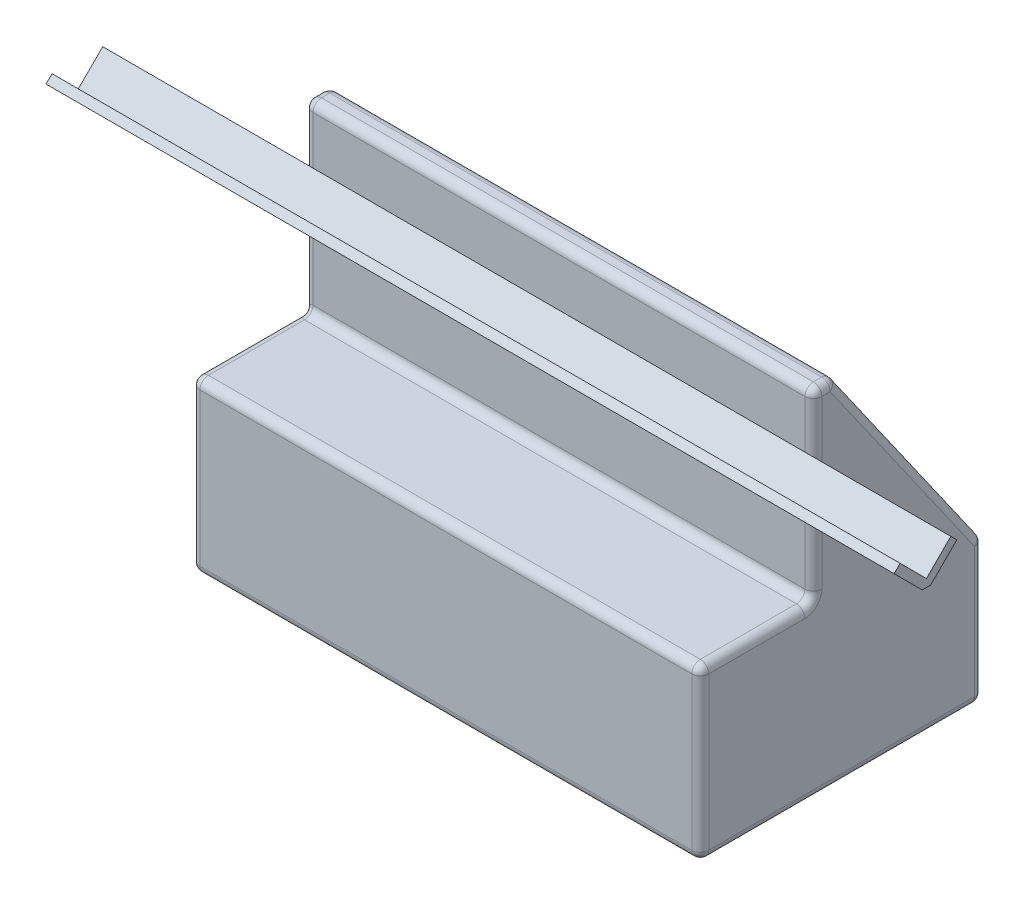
ISO-10303-21;
HEADER;
FILE_DESCRIPTION(('STEP AP214'),'2;1');
FILE_NAME('part.step','',(''),(''),'','','');
FILE_SCHEMA(('AUTOMOTIVE_DESIGN { 1 0 10303 214 1 1 1 1 }'));
ENDSEC;
DATA;
#1=APPLICATION_CONTEXT('core data for automotive mechanical design processes');
#2=APPLICATION_PROTOCOL_DEFINITION('international standard','automotive_design',2000,#1);
#3=PRODUCT_CONTEXT('',#1,'mechanical');
#4=PRODUCT('Part','Part','',(#3));
#5=PRODUCT_RELATED_PRODUCT_CATEGORY('part','',(#4));
#6=PRODUCT_DEFINITION_FORMATION('','',#4);
#7=PRODUCT_DEFINITION_CONTEXT('part definition',#1,'design');
#8=PRODUCT_DEFINITION('design','',#6,#7);
#9=PRODUCT_DEFINITION_SHAPE('','',#8);
#10=(LENGTH_UNIT() NAMED_UNIT(*) SI_UNIT(.MILLI.,.METRE.));
#11=(NAMED_UNIT(*) PLANE_ANGLE_UNIT() SI_UNIT($,.RADIAN.));
#12=(NAMED_UNIT(*) SI_UNIT($,.STERADIAN.) SOLID_ANGLE_UNIT());
#13=UNCERTAINTY_MEASURE_WITH_UNIT(LENGTH_MEASURE(1.E-05),#10,'distance_accuracy_value','');
#14=(GEOMETRIC_REPRESENTATION_CONTEXT(3) GLOBAL_UNCERTAINTY_ASSIGNED_CONTEXT((#13)) GLOBAL_UNIT_ASSIGNED_CONTEXT((#10,
#11,#12)) REPRESENTATION_CONTEXT('',''));
#15=CARTESIAN_POINT('',(0.,0.,0.));
#16=DIRECTION('',(0.,0.,1.));
#17=DIRECTION('',(1.,0.,0.));
#18=AXIS2_PLACEMENT_3D('',#15,#16,#17);
#19=CARTESIAN_POINT('',(60.,107.742640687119,-20.));
#20=DIRECTION('',(0.,0.707106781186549,0.707106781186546));
#21=DIRECTION('',(0.,-0.707106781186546,0.707106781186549));
#22=AXIS2_PLACEMENT_3D('',#19,#20,#21);
#23=PLANE('',#22);
#24=DIRECTION('',(-1.,0.,0.));
#25=VECTOR('',#24,1.);
#26=CARTESIAN_POINT('',(60.,116.356477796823,-28.613837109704));
#27=LINE('',#26,#25);
#28=CARTESIAN_POINT('',(60.,116.356477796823,-28.613837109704));
#29=VERTEX_POINT('',#28);
#30=CARTESIAN_POINT('',(-240.,116.356477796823,-28.613837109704));
#31=VERTEX_POINT('',#30);
#32=EDGE_CURVE('E60',#29,#31,#27,.T.);
#33=ORIENTED_EDGE('',*,*,#32,.T.);
#34=DIRECTION('',(0.,0.707106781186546,-0.707106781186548));
#35=VECTOR('',#34,1.);
#36=CARTESIAN_POINT('',(-240.,107.742640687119,-20.));
#37=LINE('',#36,#35);
#38=CARTESIAN_POINT('',(-240.,107.742640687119,-20.));
#39=VERTEX_POINT('',#38);
#40=EDGE_CURVE('E115',#39,#31,#37,.T.);
#41=ORIENTED_EDGE('',*,*,#40,.F.);
#42=DIRECTION('',(-1.,0.,0.));
#43=VECTOR('',#42,1.);
#44=CARTESIAN_POINT('',(60.,107.742640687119,-20.));
#45=LINE('',#44,#43);
#46=CARTESIAN_POINT('',(60.,107.742640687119,-20.));
#47=VERTEX_POINT('',#46);
#48=EDGE_CURVE('E12',#47,#39,#45,.T.);
#49=ORIENTED_EDGE('',*,*,#48,.F.);
#50=DIRECTION('',(0.,0.707106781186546,-0.707106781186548));
#51=VECTOR('',#50,1.);
#52=CARTESIAN_POINT('',(60.,107.742640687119,-20.));
#53=LINE('',#52,#51);
#54=EDGE_CURVE('E116',#47,#29,#53,.T.);
#55=ORIENTED_EDGE('',*,*,#54,.T.);
#56=EDGE_LOOP('',(#33,#41,#49,#55));
#57=FACE_BOUND('',#56,.T.);
#58=ADVANCED_FACE('F57',(#57),#23,.T.);
#59=CARTESIAN_POINT('',(60.,107.742640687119,-20.));
#60=DIRECTION('',(0.,0.707106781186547,-0.707106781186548));
#61=DIRECTION('',(0.,0.707106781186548,0.707106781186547));
#62=AXIS2_PLACEMENT_3D('',#59,#60,#61);
#63=PLANE('',#62);
#64=ORIENTED_EDGE('',*,*,#48,.T.);
#65=DIRECTION('',(0.,-0.707106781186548,-0.707106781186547));
#66=VECTOR('',#65,1.);
#67=CARTESIAN_POINT('',(-240.,107.742640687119,-20.));
#68=LINE('',#67,#66);
#69=CARTESIAN_POINT('',(-240.,117.051367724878,-10.6912729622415));
#70=VERTEX_POINT('',#69);
#71=EDGE_CURVE('E133',#70,#39,#68,.T.);
#72=ORIENTED_EDGE('',*,*,#71,.F.);
#73=DIRECTION('',(-1.,0.,0.));
#74=VECTOR('',#73,1.);
#75=CARTESIAN_POINT('',(60.,117.051367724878,-10.6912729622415));
#76=LINE('',#75,#74);
#77=CARTESIAN_POINT('',(60.,117.051367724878,-10.6912729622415));
#78=VERTEX_POINT('',#77);
#79=EDGE_CURVE('E65',#78,#70,#76,.T.);
#80=ORIENTED_EDGE('',*,*,#79,.F.);
#81=DIRECTION('',(0.,-0.707106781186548,-0.707106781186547));
#82=VECTOR('',#81,1.);
#83=CARTESIAN_POINT('',(60.,107.742640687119,-20.));
#84=LINE('',#83,#82);
#85=EDGE_CURVE('E121',#78,#47,#84,.T.);
#86=ORIENTED_EDGE('',*,*,#85,.T.);
#87=EDGE_LOOP('',(#64,#72,#80,#86));
#88=FACE_BOUND('',#87,.T.);
#89=ADVANCED_FACE('F185',(#88),#63,.T.);
#90=CARTESIAN_POINT('',(60.,117.051367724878,-10.6912729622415));
#91=DIRECTION('',(0.,0.707106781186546,0.707106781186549));
#92=DIRECTION('',(0.,-0.707106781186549,0.707106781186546));
#93=AXIS2_PLACEMENT_3D('',#90,#91,#92);
#94=PLANE('',#93);
#95=ORIENTED_EDGE('',*,*,#79,.T.);
#96=DIRECTION('',(0.,0.707106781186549,-0.707106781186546));
#97=VECTOR('',#96,1.);
#98=CARTESIAN_POINT('',(-240.,117.051367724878,-10.6912729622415));
#99=LINE('',#98,#97);
#100=CARTESIAN_POINT('',(-240.,114.930047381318,-8.5699526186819));
#101=VERTEX_POINT('',#100);
#102=EDGE_CURVE('E143',#101,#70,#99,.T.);
#103=ORIENTED_EDGE('',*,*,#102,.F.);
#104=DIRECTION('',(-1.,0.,0.));
#105=VECTOR('',#104,1.);
#106=CARTESIAN_POINT('',(60.,114.930047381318,-8.5699526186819));
#107=LINE('',#106,#105);
#108=CARTESIAN_POINT('',(60.,114.930047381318,-8.5699526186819));
#109=VERTEX_POINT('',#108);
#110=EDGE_CURVE('E162',#109,#101,#107,.T.);
#111=ORIENTED_EDGE('',*,*,#110,.F.);
#112=DIRECTION('',(0.,0.707106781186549,-0.707106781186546));
#113=VECTOR('',#112,1.);
#114=CARTESIAN_POINT('',(60.,117.051367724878,-10.6912729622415));
#115=LINE('',#114,#113);
#116=EDGE_CURVE('E158',#109,#78,#115,.T.);
#117=ORIENTED_EDGE('',*,*,#116,.T.);
#118=EDGE_LOOP('',(#95,#103,#111,#117));
#119=FACE_BOUND('',#118,.T.);
#120=ADVANCED_FACE('F183',(#119),#94,.T.);
#121=CARTESIAN_POINT('',(60.,105.,-18.5));
#122=DIRECTION('',(0.,-0.707106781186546,0.707106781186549));
#123=DIRECTION('',(0.,-0.707106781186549,-0.707106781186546));
#124=AXIS2_PLACEMENT_3D('',#121,#122,#123);
#125=PLANE('',#124);
#126=ORIENTED_EDGE('',*,*,#110,.T.);
#127=DIRECTION('',(0.,0.707106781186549,0.707106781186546));
#128=VECTOR('',#127,1.);
#129=CARTESIAN_POINT('',(-240.,105.,-18.5));
#130=LINE('',#129,#128);
#131=CARTESIAN_POINT('',(-240.,105.,-18.5));
#132=VERTEX_POINT('',#131);
#133=EDGE_CURVE('E140',#132,#101,#130,.T.);
#134=ORIENTED_EDGE('',*,*,#133,.F.);
#135=DIRECTION('',(-1.,0.,0.));
#136=VECTOR('',#135,1.);
#137=CARTESIAN_POINT('',(60.,105.,-18.5));
#138=LINE('',#137,#136);
#139=CARTESIAN_POINT('',(60.,105.,-18.5));
#140=VERTEX_POINT('',#139);
#141=EDGE_CURVE('E164',#140,#132,#138,.T.);
#142=ORIENTED_EDGE('',*,*,#141,.F.);
#143=DIRECTION('',(0.,0.707106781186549,0.707106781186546));
#144=VECTOR('',#143,1.);
#145=CARTESIAN_POINT('',(60.,105.,-18.5));
#146=LINE('',#145,#144);
#147=EDGE_CURVE('E155',#140,#109,#146,.T.);
#148=ORIENTED_EDGE('',*,*,#147,.T.);
#149=EDGE_LOOP('',(#126,#134,#142,#148));
#150=FACE_BOUND('',#149,.T.);
#151=ADVANCED_FACE('F177',(#150),#125,.T.);
#152=CARTESIAN_POINT('',(60.,105.,-21.5));
#153=DIRECTION('',(0.,-1.,0.));
#154=DIRECTION('',(0.,0.,-1.));
#155=AXIS2_PLACEMENT_3D('',#152,#153,#154);
#156=PLANE('',#155);
#157=ORIENTED_EDGE('',*,*,#141,.T.);
#158=DIRECTION('',(0.,0.,1.));
#159=VECTOR('',#158,1.);
#160=CARTESIAN_POINT('',(-240.,105.,-21.5));
#161=LINE('',#160,#159);
#162=CARTESIAN_POINT('',(-240.,105.,-21.5));
#163=VERTEX_POINT('',#162);
#164=EDGE_CURVE('E137',#163,#132,#161,.T.);
#165=ORIENTED_EDGE('',*,*,#164,.F.);
#166=DIRECTION('',(-1.,0.,0.));
#167=VECTOR('',#166,1.);
#168=CARTESIAN_POINT('',(60.,105.,-21.5));
#169=LINE('',#168,#167);
#170=CARTESIAN_POINT('',(60.,105.,-21.5));
#171=VERTEX_POINT('',#170);
#172=EDGE_CURVE('E166',#171,#163,#169,.T.);
#173=ORIENTED_EDGE('',*,*,#172,.F.);
#174=DIRECTION('',(0.,0.,1.));
#175=VECTOR('',#174,1.);
#176=CARTESIAN_POINT('',(60.,105.,-21.5));
#177=LINE('',#176,#175);
#178=EDGE_CURVE('E152',#171,#140,#177,.T.);
#179=ORIENTED_EDGE('',*,*,#178,.T.);
#180=EDGE_LOOP('',(#157,#165,#173,#179));
#181=FACE_BOUND('',#180,.T.);
#182=ADVANCED_FACE('F174',(#181),#156,.T.);
#183=CARTESIAN_POINT('',(60.,114.235157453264,-30.7351574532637));
#184=DIRECTION('',(0.,-0.707106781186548,-0.707106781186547));
#185=DIRECTION('',(0.,0.707106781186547,-0.707106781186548));
#186=AXIS2_PLACEMENT_3D('',#183,#184,#185);
#187=PLANE('',#186);
#188=ORIENTED_EDGE('',*,*,#172,.T.);
#189=DIRECTION('',(0.,-0.707106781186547,0.707106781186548));
#190=VECTOR('',#189,1.);
#191=CARTESIAN_POINT('',(-240.,114.235157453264,-30.7351574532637));
#192=LINE('',#191,#190);
#193=CARTESIAN_POINT('',(-240.,114.235157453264,-30.7351574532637));
#194=VERTEX_POINT('',#193);
#195=EDGE_CURVE('E128',#194,#163,#192,.T.);
#196=ORIENTED_EDGE('',*,*,#195,.F.);
#197=DIRECTION('',(-1.,0.,0.));
#198=VECTOR('',#197,1.);
#199=CARTESIAN_POINT('',(60.,114.235157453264,-30.7351574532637));
#200=LINE('',#199,#198);
#201=CARTESIAN_POINT('',(60.,114.235157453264,-30.7351574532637));
#202=VERTEX_POINT('',#201);
#203=EDGE_CURVE('E120',#202,#194,#200,.T.);
#204=ORIENTED_EDGE('',*,*,#203,.F.);
#205=DIRECTION('',(0.,-0.707106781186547,0.707106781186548));
#206=VECTOR('',#205,1.);
#207=CARTESIAN_POINT('',(60.,114.235157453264,-30.7351574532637));
#208=LINE('',#207,#206);
#209=EDGE_CURVE('E149',#202,#171,#208,.T.);
#210=ORIENTED_EDGE('',*,*,#209,.T.);
#211=EDGE_LOOP('',(#188,#196,#204,#210));
#212=FACE_BOUND('',#211,.T.);
#213=ADVANCED_FACE('F168',(#212),#187,.T.);
#214=CARTESIAN_POINT('',(60.,116.356477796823,-28.613837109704));
#215=DIRECTION('',(0.,0.707106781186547,-0.707106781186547));
#216=DIRECTION('',(0.,0.707106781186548,0.707106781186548));
#217=AXIS2_PLACEMENT_3D('',#214,#215,#216);
#218=PLANE('',#217);
#219=ORIENTED_EDGE('',*,*,#203,.T.);
#220=DIRECTION('',(0.,-0.707106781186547,-0.707106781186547));
#221=VECTOR('',#220,1.);
#222=CARTESIAN_POINT('',(-240.,116.356477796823,-28.613837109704));
#223=LINE('',#222,#221);
#224=EDGE_CURVE('E123',#31,#194,#223,.T.);
#225=ORIENTED_EDGE('',*,*,#224,.F.);
#226=ORIENTED_EDGE('',*,*,#32,.F.);
#227=DIRECTION('',(0.,-0.707106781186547,-0.707106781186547));
#228=VECTOR('',#227,1.);
#229=CARTESIAN_POINT('',(60.,116.356477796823,-28.613837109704));
#230=LINE('',#229,#228);
#231=EDGE_CURVE('E147',#29,#202,#230,.T.);
#232=ORIENTED_EDGE('',*,*,#231,.T.);
#233=EDGE_LOOP('',(#219,#225,#226,#232));
#234=FACE_BOUND('',#233,.T.);
#235=ADVANCED_FACE('F124',(#234),#218,.T.);
#236=CARTESIAN_POINT('',(60.,0.,0.));
#237=DIRECTION('',(-1.,0.,0.));
#238=DIRECTION('',(0.,0.,1.));
#239=AXIS2_PLACEMENT_3D('',#236,#237,#238);
#240=PLANE('',#239);
#241=ORIENTED_EDGE('',*,*,#54,.F.);
#242=ORIENTED_EDGE('',*,*,#85,.F.);
#243=ORIENTED_EDGE('',*,*,#116,.F.);
#244=ORIENTED_EDGE('',*,*,#147,.F.);
#245=ORIENTED_EDGE('',*,*,#178,.F.);
#246=ORIENTED_EDGE('',*,*,#209,.F.);
#247=ORIENTED_EDGE('',*,*,#231,.F.);
#248=EDGE_LOOP('',(#241,#242,#243,#244,#245,#246,#247));
#249=FACE_BOUND('',#248,.T.);
#250=ADVANCED_FACE('F180',(#249),#240,.F.);
#251=CARTESIAN_POINT('',(-240.,0.,0.));
#252=DIRECTION('',(-1.,0.,0.));
#253=DIRECTION('',(0.,0.,1.));
#254=AXIS2_PLACEMENT_3D('',#251,#252,#253);
#255=PLANE('',#254);
#256=ORIENTED_EDGE('',*,*,#40,.T.);
#257=ORIENTED_EDGE('',*,*,#224,.T.);
#258=ORIENTED_EDGE('',*,*,#195,.T.);
#259=ORIENTED_EDGE('',*,*,#164,.T.);
#260=ORIENTED_EDGE('',*,*,#133,.T.);
#261=ORIENTED_EDGE('',*,*,#102,.T.);
#262=ORIENTED_EDGE('',*,*,#71,.T.);
#263=EDGE_LOOP('',(#256,#257,#258,#259,#260,#261,#262));
#264=FACE_BOUND('',#263,.T.);
#265=ADVANCED_FACE('F131',(#264),#255,.T.);
#266=CLOSED_SHELL('',(#58,#89,#120,#151,#182,#213,#235,#250,#265));
#267=MANIFOLD_SOLID_BREP('B2',#266);
#268=CARTESIAN_POINT('',(0.,0.,0.));
#269=DIRECTION('',(1.,0.,0.));
#270=DIRECTION('',(0.,0.,-1.));
#271=AXIS2_PLACEMENT_3D('',#268,#269,#270);
#272=PLANE('',#271);
#273=CARTESIAN_POINT('',(0.,63.,-37.));
#274=DIRECTION('',(1.,0.,0.));
#275=DIRECTION('',(0.,0.,-1.));
#276=AXIS2_PLACEMENT_3D('',#273,#274,#275);
#277=CIRCLE('',#276,6.);
#278=CARTESIAN_POINT('',(0.,57.,-37.));
#279=VERTEX_POINT('',#278);
#280=CARTESIAN_POINT('',(0.,63.,-43.));
#281=VERTEX_POINT('',#280);
#282=EDGE_CURVE('E55',#279,#281,#277,.T.);
#283=ORIENTED_EDGE('',*,*,#282,.F.);
#284=DIRECTION('',(0.,0.,1.));
#285=VECTOR('',#284,1.);
#286=CARTESIAN_POINT('',(0.,57.,0.));
#287=LINE('',#286,#285);
#288=CARTESIAN_POINT('',(0.,57.,-3.));
#289=VERTEX_POINT('',#288);
#290=EDGE_CURVE('E271',#279,#289,#287,.T.);
#291=ORIENTED_EDGE('',*,*,#290,.T.);
#292=DIRECTION('',(0.,-1.,0.));
#293=VECTOR('',#292,1.);
#294=CARTESIAN_POINT('',(0.,0.,-3.));
#295=LINE('',#294,#293);
#296=CARTESIAN_POINT('',(0.,3.,-3.));
#297=VERTEX_POINT('',#296);
#298=EDGE_CURVE('E644',#289,#297,#295,.T.);
#299=ORIENTED_EDGE('',*,*,#298,.T.);
#300=DIRECTION('',(0.,0.,-1.));
#301=VECTOR('',#300,1.);
#302=CARTESIAN_POINT('',(0.,3.,0.));
#303=LINE('',#302,#301);
#304=CARTESIAN_POINT('',(0.,3.,-97.));
#305=VERTEX_POINT('',#304);
#306=EDGE_CURVE('E647',#297,#305,#303,.T.);
#307=ORIENTED_EDGE('',*,*,#306,.T.);
#308=DIRECTION('',(0.,1.,0.));
#309=VECTOR('',#308,1.);
#310=CARTESIAN_POINT('',(0.,0.,-97.));
#311=LINE('',#310,#309);
#312=CARTESIAN_POINT('',(0.,49.0541036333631,-97.));
#313=VERTEX_POINT('',#312);
#314=EDGE_CURVE('E650',#305,#313,#311,.T.);
#315=ORIENTED_EDGE('',*,*,#314,.T.);
#316=DIRECTION('',(0.,0.819152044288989,0.57357643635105));
#317=VECTOR('',#316,1.);
#318=CARTESIAN_POINT('',(0.,61.713398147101,-88.1358665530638));
#319=LINE('',#318,#317);
#320=CARTESIAN_POINT('',(0.,122.,-45.9227334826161));
#321=VERTEX_POINT('',#320);
#322=EDGE_CURVE('E653',#313,#321,#319,.T.);
#323=ORIENTED_EDGE('',*,*,#322,.T.);
#324=DIRECTION('',(0.,0.,1.));
#325=VECTOR('',#324,1.);
#326=CARTESIAN_POINT('',(0.,122.,0.));
#327=LINE('',#326,#325);
#328=CARTESIAN_POINT('',(0.,122.,-43.));
#329=VERTEX_POINT('',#328);
#330=EDGE_CURVE('E656',#321,#329,#327,.T.);
#331=ORIENTED_EDGE('',*,*,#330,.T.);
#332=DIRECTION('',(0.,-1.,0.));
#333=VECTOR('',#332,1.);
#334=CARTESIAN_POINT('',(0.,0.,-43.));
#335=LINE('',#334,#333);
#336=EDGE_CURVE('E282',#329,#281,#335,.T.);
#337=ORIENTED_EDGE('',*,*,#336,.T.);
#338=EDGE_LOOP('',(#283,#291,#299,#307,#315,#323,#331,#337));
#339=FACE_BOUND('',#338,.T.);
#340=ADVANCED_FACE('F260',(#339),#272,.T.);
#341=CARTESIAN_POINT('',(-3.,60.,0.));
#342=DIRECTION('',(0.,0.,1.));
#343=DIRECTION('',(0.,-1.,0.));
#344=AXIS2_PLACEMENT_3D('',#341,#342,#343);
#345=PLANE('',#344);
#346=DIRECTION('',(0.,-1.,0.));
#347=VECTOR('',#346,1.);
#348=CARTESIAN_POINT('',(-3.,60.,0.));
#349=LINE('',#348,#347);
#350=CARTESIAN_POINT('',(-3.,3.,0.));
#351=VERTEX_POINT('',#350);
#352=CARTESIAN_POINT('',(-3.,57.,0.));
#353=VERTEX_POINT('',#352);
#354=EDGE_CURVE('E608',#351,#353,#349,.F.);
#355=ORIENTED_EDGE('',*,*,#354,.T.);
#356=DIRECTION('',(1.,0.,0.));
#357=VECTOR('',#356,1.);
#358=CARTESIAN_POINT('',(-3.,57.,0.));
#359=LINE('',#358,#357);
#360=CARTESIAN_POINT('',(-177.,57.,0.));
#361=VERTEX_POINT('',#360);
#362=EDGE_CURVE('E614',#353,#361,#359,.F.);
#363=ORIENTED_EDGE('',*,*,#362,.T.);
#364=DIRECTION('',(0.,1.,0.));
#365=VECTOR('',#364,1.);
#366=CARTESIAN_POINT('',(-177.,0.,0.));
#367=LINE('',#366,#365);
#368=CARTESIAN_POINT('',(-177.,3.,0.));
#369=VERTEX_POINT('',#368);
#370=EDGE_CURVE('E530',#361,#369,#367,.F.);
#371=ORIENTED_EDGE('',*,*,#370,.T.);
#372=DIRECTION('',(1.,0.,0.));
#373=VECTOR('',#372,1.);
#374=CARTESIAN_POINT('',(-3.,3.,0.));
#375=LINE('',#374,#373);
#376=EDGE_CURVE('E611',#369,#351,#375,.T.);
#377=ORIENTED_EDGE('',*,*,#376,.T.);
#378=EDGE_LOOP('',(#355,#363,#371,#377));
#379=FACE_BOUND('',#378,.T.);
#380=ADVANCED_FACE('F787',(#379),#345,.T.);
#381=CARTESIAN_POINT('',(-3.,60.,-40.));
#382=DIRECTION('',(0.,1.,0.));
#383=DIRECTION('',(0.,0.,1.));
#384=AXIS2_PLACEMENT_3D('',#381,#382,#383);
#385=PLANE('',#384);
#386=DIRECTION('',(0.,0.,1.));
#387=VECTOR('',#386,1.);
#388=CARTESIAN_POINT('',(-3.,60.,-40.));
#389=LINE('',#388,#387);
#390=CARTESIAN_POINT('',(-3.,60.,-3.));
#391=VERTEX_POINT('',#390);
#392=CARTESIAN_POINT('',(-3.,60.,-37.));
#393=VERTEX_POINT('',#392);
#394=EDGE_CURVE('E599',#391,#393,#389,.F.);
#395=ORIENTED_EDGE('',*,*,#394,.T.);
#396=DIRECTION('',(1.,0.,0.));
#397=VECTOR('',#396,1.);
#398=CARTESIAN_POINT('',(-177.,60.,-37.));
#399=LINE('',#398,#397);
#400=CARTESIAN_POINT('',(-177.,60.,-37.));
#401=VERTEX_POINT('',#400);
#402=EDGE_CURVE('E605',#393,#401,#399,.F.);
#403=ORIENTED_EDGE('',*,*,#402,.T.);
#404=DIRECTION('',(0.,0.,-1.));
#405=VECTOR('',#404,1.);
#406=CARTESIAN_POINT('',(-177.,60.,0.));
#407=LINE('',#406,#405);
#408=CARTESIAN_POINT('',(-177.,60.,-3.));
#409=VERTEX_POINT('',#408);
#410=EDGE_CURVE('E526',#401,#409,#407,.F.);
#411=ORIENTED_EDGE('',*,*,#410,.T.);
#412=DIRECTION('',(1.,0.,0.));
#413=VECTOR('',#412,1.);
#414=CARTESIAN_POINT('',(-3.,60.,-3.));
#415=LINE('',#414,#413);
#416=EDGE_CURVE('E602',#409,#391,#415,.T.);
#417=ORIENTED_EDGE('',*,*,#416,.T.);
#418=EDGE_LOOP('',(#395,#403,#411,#417));
#419=FACE_BOUND('',#418,.T.);
#420=ADVANCED_FACE('F793',(#419),#385,.T.);
#421=CARTESIAN_POINT('',(-3.,125.,-40.));
#422=DIRECTION('',(0.,0.,1.));
#423=DIRECTION('',(0.,-1.,0.));
#424=AXIS2_PLACEMENT_3D('',#421,#422,#423);
#425=PLANE('',#424);
#426=DIRECTION('',(0.,-1.,0.));
#427=VECTOR('',#426,1.);
#428=CARTESIAN_POINT('',(-3.,125.,-40.));
#429=LINE('',#428,#427);
#430=CARTESIAN_POINT('',(-3.,63.,-40.));
#431=VERTEX_POINT('',#430);
#432=CARTESIAN_POINT('',(-3.,122.,-40.));
#433=VERTEX_POINT('',#432);
#434=EDGE_CURVE('E590',#431,#433,#429,.F.);
#435=ORIENTED_EDGE('',*,*,#434,.T.);
#436=DIRECTION('',(1.,0.,0.));
#437=VECTOR('',#436,1.);
#438=CARTESIAN_POINT('',(-3.,122.,-40.));
#439=LINE('',#438,#437);
#440=CARTESIAN_POINT('',(-177.,122.,-40.));
#441=VERTEX_POINT('',#440);
#442=EDGE_CURVE('E596',#433,#441,#439,.F.);
#443=ORIENTED_EDGE('',*,*,#442,.T.);
#444=DIRECTION('',(0.,1.,0.));
#445=VECTOR('',#444,1.);
#446=CARTESIAN_POINT('',(-177.,60.,-40.));
#447=LINE('',#446,#445);
#448=CARTESIAN_POINT('',(-177.,63.,-40.));
#449=VERTEX_POINT('',#448);
#450=EDGE_CURVE('E522',#441,#449,#447,.F.);
#451=ORIENTED_EDGE('',*,*,#450,.T.);
#452=DIRECTION('',(1.,0.,0.));
#453=VECTOR('',#452,1.);
#454=CARTESIAN_POINT('',(0.,63.,-40.));
#455=LINE('',#454,#453);
#456=EDGE_CURVE('E593',#449,#431,#455,.T.);
#457=ORIENTED_EDGE('',*,*,#456,.T.);
#458=EDGE_LOOP('',(#435,#443,#451,#457));
#459=FACE_BOUND('',#458,.T.);
#460=ADVANCED_FACE('F802',(#459),#425,.T.);
#461=CARTESIAN_POINT('',(-3.,125.,-47.4844346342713));
#462=DIRECTION('',(0.,1.,0.));
#463=DIRECTION('',(0.,0.,1.));
#464=AXIS2_PLACEMENT_3D('',#461,#462,#463);
#465=PLANE('',#464);
#466=DIRECTION('',(0.,0.,-1.));
#467=VECTOR('',#466,1.);
#468=CARTESIAN_POINT('',(-177.,125.,-40.));
#469=LINE('',#468,#467);
#470=CARTESIAN_POINT('',(-177.,125.,-45.922733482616));
#471=VERTEX_POINT('',#470);
#472=CARTESIAN_POINT('',(-177.,125.,-43.));
#473=VERTEX_POINT('',#472);
#474=EDGE_CURVE('E518',#471,#473,#469,.F.);
#475=ORIENTED_EDGE('',*,*,#474,.T.);
#476=DIRECTION('',(1.,0.,0.));
#477=VECTOR('',#476,1.);
#478=CARTESIAN_POINT('',(-3.,125.,-43.));
#479=LINE('',#478,#477);
#480=CARTESIAN_POINT('',(-3.,125.,-43.));
#481=VERTEX_POINT('',#480);
#482=EDGE_CURVE('E587',#473,#481,#479,.T.);
#483=ORIENTED_EDGE('',*,*,#482,.T.);
#484=DIRECTION('',(0.,0.,1.));
#485=VECTOR('',#484,1.);
#486=CARTESIAN_POINT('',(-3.,125.,-47.4844346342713));
#487=LINE('',#486,#485);
#488=CARTESIAN_POINT('',(-3.,125.,-45.922733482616));
#489=VERTEX_POINT('',#488);
#490=EDGE_CURVE('E581',#481,#489,#487,.F.);
#491=ORIENTED_EDGE('',*,*,#490,.T.);
#492=DIRECTION('',(1.,0.,0.));
#493=VECTOR('',#492,1.);
#494=CARTESIAN_POINT('',(-3.,125.,-45.922733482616));
#495=LINE('',#494,#493);
#496=EDGE_CURVE('E584',#489,#471,#495,.F.);
#497=ORIENTED_EDGE('',*,*,#496,.T.);
#498=EDGE_LOOP('',(#475,#483,#491,#497));
#499=FACE_BOUND('',#498,.T.);
#500=ADVANCED_FACE('F806',(#499),#465,.T.);
#501=CARTESIAN_POINT('',(-3.,50.,-100.));
#502=DIRECTION('',(0.,0.57357643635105,-0.819152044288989));
#503=DIRECTION('',(0.,0.819152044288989,0.57357643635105));
#504=AXIS2_PLACEMENT_3D('',#501,#502,#503);
#505=PLANE('',#504);
#506=DIRECTION('',(0.,-0.819152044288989,-0.57357643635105));
#507=VECTOR('',#506,1.);
#508=CARTESIAN_POINT('',(-177.,125.,-47.4844346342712));
#509=LINE('',#508,#507);
#510=CARTESIAN_POINT('',(-177.,50.7748329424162,-99.457456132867));
#511=VERTEX_POINT('',#510);
#512=CARTESIAN_POINT('',(-177.,123.720729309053,-48.380189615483));
#513=VERTEX_POINT('',#512);
#514=EDGE_CURVE('E514',#511,#513,#509,.F.);
#515=ORIENTED_EDGE('',*,*,#514,.T.);
#516=DIRECTION('',(1.,0.,0.));
#517=VECTOR('',#516,1.);
#518=CARTESIAN_POINT('',(-3.,123.720729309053,-48.380189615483));
#519=LINE('',#518,#517);
#520=CARTESIAN_POINT('',(-3.,123.720729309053,-48.380189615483));
#521=VERTEX_POINT('',#520);
#522=EDGE_CURVE('E632',#513,#521,#519,.T.);
#523=ORIENTED_EDGE('',*,*,#522,.T.);
#524=DIRECTION('',(0.,0.819152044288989,0.57357643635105));
#525=VECTOR('',#524,1.);
#526=CARTESIAN_POINT('',(-3.,50.,-100.));
#527=LINE('',#526,#525);
#528=CARTESIAN_POINT('',(-3.,50.7748329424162,-99.457456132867));
#529=VERTEX_POINT('',#528);
#530=EDGE_CURVE('E626',#521,#529,#527,.F.);
#531=ORIENTED_EDGE('',*,*,#530,.T.);
#532=DIRECTION('',(1.,0.,0.));
#533=VECTOR('',#532,1.);
#534=CARTESIAN_POINT('',(-3.,50.7748329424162,-99.457456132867));
#535=LINE('',#534,#533);
#536=EDGE_CURVE('E629',#529,#511,#535,.F.);
#537=ORIENTED_EDGE('',*,*,#536,.T.);
#538=EDGE_LOOP('',(#515,#523,#531,#537));
#539=FACE_BOUND('',#538,.T.);
#540=ADVANCED_FACE('F810',(#539),#505,.T.);
#541=CARTESIAN_POINT('',(-3.,0.,-100.));
#542=DIRECTION('',(0.,0.,-1.));
#543=DIRECTION('',(0.,1.,0.));
#544=AXIS2_PLACEMENT_3D('',#541,#542,#543);
#545=PLANE('',#544);
#546=DIRECTION('',(0.,-1.,0.));
#547=VECTOR('',#546,1.);
#548=CARTESIAN_POINT('',(-177.,50.,-100.));
#549=LINE('',#548,#547);
#550=CARTESIAN_POINT('',(-177.,3.,-100.));
#551=VERTEX_POINT('',#550);
#552=CARTESIAN_POINT('',(-177.,49.054103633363,-100.));
#553=VERTEX_POINT('',#552);
#554=EDGE_CURVE('E510',#551,#553,#549,.F.);
#555=ORIENTED_EDGE('',*,*,#554,.T.);
#556=DIRECTION('',(1.,0.,0.));
#557=VECTOR('',#556,1.);
#558=CARTESIAN_POINT('',(-3.,49.054103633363,-100.));
#559=LINE('',#558,#557);
#560=CARTESIAN_POINT('',(-3.,49.054103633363,-100.));
#561=VERTEX_POINT('',#560);
#562=EDGE_CURVE('E641',#553,#561,#559,.T.);
#563=ORIENTED_EDGE('',*,*,#562,.T.);
#564=DIRECTION('',(0.,1.,0.));
#565=VECTOR('',#564,1.);
#566=CARTESIAN_POINT('',(-3.,0.,-100.));
#567=LINE('',#566,#565);
#568=CARTESIAN_POINT('',(-3.,3.,-100.));
#569=VERTEX_POINT('',#568);
#570=EDGE_CURVE('E635',#561,#569,#567,.F.);
#571=ORIENTED_EDGE('',*,*,#570,.T.);
#572=DIRECTION('',(1.,0.,0.));
#573=VECTOR('',#572,1.);
#574=CARTESIAN_POINT('',(-3.,3.,-100.));
#575=LINE('',#574,#573);
#576=EDGE_CURVE('E638',#569,#551,#575,.F.);
#577=ORIENTED_EDGE('',*,*,#576,.T.);
#578=EDGE_LOOP('',(#555,#563,#571,#577));
#579=FACE_BOUND('',#578,.T.);
#580=ADVANCED_FACE('F814',(#579),#545,.T.);
#581=CARTESIAN_POINT('',(-3.,0.,0.));
#582=DIRECTION('',(0.,-1.,0.));
#583=DIRECTION('',(0.,0.,-1.));
#584=AXIS2_PLACEMENT_3D('',#581,#582,#583);
#585=PLANE('',#584);
#586=DIRECTION('',(0.,0.,-1.));
#587=VECTOR('',#586,1.);
#588=CARTESIAN_POINT('',(-3.,0.,0.));
#589=LINE('',#588,#587);
#590=CARTESIAN_POINT('',(-3.,0.,-97.));
#591=VERTEX_POINT('',#590);
#592=CARTESIAN_POINT('',(-3.,0.,-3.));
#593=VERTEX_POINT('',#592);
#594=EDGE_CURVE('E617',#591,#593,#589,.F.);
#595=ORIENTED_EDGE('',*,*,#594,.T.);
#596=DIRECTION('',(1.,0.,0.));
#597=VECTOR('',#596,1.);
#598=CARTESIAN_POINT('',(-3.,0.,-3.));
#599=LINE('',#598,#597);
#600=CARTESIAN_POINT('',(-177.,0.,-3.));
#601=VERTEX_POINT('',#600);
#602=EDGE_CURVE('E623',#593,#601,#599,.F.);
#603=ORIENTED_EDGE('',*,*,#602,.T.);
#604=DIRECTION('',(0.,0.,1.));
#605=VECTOR('',#604,1.);
#606=CARTESIAN_POINT('',(-177.,0.,-100.));
#607=LINE('',#606,#605);
#608=CARTESIAN_POINT('',(-177.,0.,-97.));
#609=VERTEX_POINT('',#608);
#610=EDGE_CURVE('E534',#601,#609,#607,.F.);
#611=ORIENTED_EDGE('',*,*,#610,.T.);
#612=DIRECTION('',(1.,0.,0.));
#613=VECTOR('',#612,1.);
#614=CARTESIAN_POINT('',(-3.,0.,-97.));
#615=LINE('',#614,#613);
#616=EDGE_CURVE('E620',#609,#591,#615,.T.);
#617=ORIENTED_EDGE('',*,*,#616,.T.);
#618=EDGE_LOOP('',(#595,#603,#611,#617));
#619=FACE_BOUND('',#618,.T.);
#620=ADVANCED_FACE('F818',(#619),#585,.T.);
#621=CARTESIAN_POINT('',(-180.,0.,0.));
#622=DIRECTION('',(1.,0.,0.));
#623=DIRECTION('',(0.,0.,-1.));
#624=AXIS2_PLACEMENT_3D('',#621,#622,#623);
#625=PLANE('',#624);
#626=DIRECTION('',(0.,-0.819152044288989,-0.57357643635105));
#627=VECTOR('',#626,1.);
#628=CARTESIAN_POINT('',(-180.,48.2792706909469,-97.5425438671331));
#629=LINE('',#628,#627);
#630=CARTESIAN_POINT('',(-180.,122.,-45.9227334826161));
#631=VERTEX_POINT('',#630);
#632=CARTESIAN_POINT('',(-180.,49.0541036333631,-97.));
#633=VERTEX_POINT('',#632);
#634=EDGE_CURVE('E502',#631,#633,#629,.T.);
#635=ORIENTED_EDGE('',*,*,#634,.T.);
#636=DIRECTION('',(0.,-1.,0.));
#637=VECTOR('',#636,1.);
#638=CARTESIAN_POINT('',(-180.,0.,-97.));
#639=LINE('',#638,#637);
#640=CARTESIAN_POINT('',(-180.,3.,-97.));
#641=VERTEX_POINT('',#640);
#642=EDGE_CURVE('E506',#633,#641,#639,.T.);
#643=ORIENTED_EDGE('',*,*,#642,.T.);
#644=DIRECTION('',(0.,0.,1.));
#645=VECTOR('',#644,1.);
#646=CARTESIAN_POINT('',(-180.,3.,0.));
#647=LINE('',#646,#645);
#648=CARTESIAN_POINT('',(-180.,3.,-3.));
#649=VERTEX_POINT('',#648);
#650=EDGE_CURVE('E475',#641,#649,#647,.T.);
#651=ORIENTED_EDGE('',*,*,#650,.T.);
#652=DIRECTION('',(0.,1.,0.));
#653=VECTOR('',#652,1.);
#654=CARTESIAN_POINT('',(-180.,60.,-3.));
#655=LINE('',#654,#653);
#656=CARTESIAN_POINT('',(-180.,57.,-3.));
#657=VERTEX_POINT('',#656);
#658=EDGE_CURVE('E481',#649,#657,#655,.T.);
#659=ORIENTED_EDGE('',*,*,#658,.T.);
#660=DIRECTION('',(0.,0.,-1.));
#661=VECTOR('',#660,1.);
#662=CARTESIAN_POINT('',(-180.,57.,-40.));
#663=LINE('',#662,#661);
#664=CARTESIAN_POINT('',(-180.,57.,-43.));
#665=VERTEX_POINT('',#664);
#666=EDGE_CURVE('E490',#657,#665,#663,.T.);
#667=ORIENTED_EDGE('',*,*,#666,.T.);
#668=DIRECTION('',(0.,1.,0.));
#669=VECTOR('',#668,1.);
#670=CARTESIAN_POINT('',(-180.,125.,-43.));
#671=LINE('',#670,#669);
#672=CARTESIAN_POINT('',(-180.,122.,-43.));
#673=VERTEX_POINT('',#672);
#674=EDGE_CURVE('E494',#665,#673,#671,.T.);
#675=ORIENTED_EDGE('',*,*,#674,.T.);
#676=DIRECTION('',(0.,0.,-1.));
#677=VECTOR('',#676,1.);
#678=CARTESIAN_POINT('',(-180.,122.,-47.4844346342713));
#679=LINE('',#678,#677);
#680=EDGE_CURVE('E498',#673,#631,#679,.T.);
#681=ORIENTED_EDGE('',*,*,#680,.T.);
#682=EDGE_LOOP('',(#635,#643,#651,#659,#667,#675,#681));
#683=FACE_BOUND('',#682,.T.);
#684=ADVANCED_FACE('F742',(#683),#625,.F.);
#685=CARTESIAN_POINT('',(-177.,0.,-43.));
#686=DIRECTION('',(0.,-1.,0.));
#687=DIRECTION('',(0.,0.,-1.));
#688=AXIS2_PLACEMENT_3D('',#685,#686,#687);
#689=CYLINDRICAL_SURFACE('',#688,3.);
#690=ORIENTED_EDGE('',*,*,#450,.F.);
#691=CARTESIAN_POINT('',(-177.,122.,-43.));
#692=DIRECTION('',(0.,-1.,0.));
#693=DIRECTION('',(0.,0.,-1.));
#694=AXIS2_PLACEMENT_3D('',#691,#692,#693);
#695=CIRCLE('',#694,3.);
#696=EDGE_CURVE('E548',#441,#673,#695,.T.);
#697=ORIENTED_EDGE('',*,*,#696,.T.);
#698=ORIENTED_EDGE('',*,*,#674,.F.);
#699=CARTESIAN_POINT('',(-177.,57.,-43.));
#700=DIRECTION('',(0.,0.447213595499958,-0.894427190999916));
#701=DIRECTION('',(0.,0.894427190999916,0.447213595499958));
#702=AXIS2_PLACEMENT_3D('',#699,#700,#701);
#703=ELLIPSE('',#702,6.70820393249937,3.);
#704=EDGE_CURVE('E545',#665,#449,#703,.T.);
#705=ORIENTED_EDGE('',*,*,#704,.T.);
#706=EDGE_LOOP('',(#690,#697,#698,#705));
#707=FACE_BOUND('',#706,.T.);
#708=ADVANCED_FACE('F738',(#707),#689,.T.);
#709=CARTESIAN_POINT('',(-177.,57.,0.));
#710=DIRECTION('',(0.,0.,1.));
#711=DIRECTION('',(0.,-1.,0.));
#712=AXIS2_PLACEMENT_3D('',#709,#710,#711);
#713=CYLINDRICAL_SURFACE('',#712,3.);
#714=ORIENTED_EDGE('',*,*,#410,.F.);
#715=CARTESIAN_POINT('',(-177.,57.,-43.));
#716=DIRECTION('',(0.,0.894427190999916,-0.447213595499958));
#717=DIRECTION('',(0.,0.447213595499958,0.894427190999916));
#718=AXIS2_PLACEMENT_3D('',#715,#716,#717);
#719=ELLIPSE('',#718,6.70820393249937,3.);
#720=EDGE_CURVE('E554',#401,#665,#719,.F.);
#721=ORIENTED_EDGE('',*,*,#720,.T.);
#722=ORIENTED_EDGE('',*,*,#666,.F.);
#723=CARTESIAN_POINT('',(-177.,57.,-3.));
#724=DIRECTION('',(0.,0.,1.));
#725=DIRECTION('',(0.,-1.,0.));
#726=AXIS2_PLACEMENT_3D('',#723,#724,#725);
#727=CIRCLE('',#726,3.);
#728=EDGE_CURVE('E551',#657,#409,#727,.F.);
#729=ORIENTED_EDGE('',*,*,#728,.T.);
#730=EDGE_LOOP('',(#714,#721,#722,#729));
#731=FACE_BOUND('',#730,.T.);
#732=ADVANCED_FACE('F735',(#731),#713,.T.);
#733=CARTESIAN_POINT('',(-177.,122.,0.));
#734=DIRECTION('',(0.,0.,1.));
#735=DIRECTION('',(1.,0.,0.));
#736=AXIS2_PLACEMENT_3D('',#733,#734,#735);
#737=CYLINDRICAL_SURFACE('',#736,3.);
#738=ORIENTED_EDGE('',*,*,#680,.F.);
#739=CARTESIAN_POINT('',(-177.,122.,-43.));
#740=DIRECTION('',(0.,0.,1.));
#741=DIRECTION('',(1.,0.,0.));
#742=AXIS2_PLACEMENT_3D('',#739,#740,#741);
#743=CIRCLE('',#742,3.);
#744=EDGE_CURVE('E541',#673,#473,#743,.F.);
#745=ORIENTED_EDGE('',*,*,#744,.T.);
#746=ORIENTED_EDGE('',*,*,#474,.F.);
#747=CARTESIAN_POINT('',(-177.,122.,-45.9227334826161));
#748=DIRECTION('',(0.,0.,1.));
#749=DIRECTION('',(1.,0.,0.));
#750=AXIS2_PLACEMENT_3D('',#747,#748,#749);
#751=CIRCLE('',#750,3.);
#752=EDGE_CURVE('E538',#471,#631,#751,.T.);
#753=ORIENTED_EDGE('',*,*,#752,.T.);
#754=EDGE_LOOP('',(#738,#745,#746,#753));
#755=FACE_BOUND('',#754,.T.);
#756=ADVANCED_FACE('F837',(#755),#737,.T.);
#757=CARTESIAN_POINT('',(-177.,0.,-3.));
#758=DIRECTION('',(0.,-1.,0.));
#759=DIRECTION('',(0.,0.,-1.));
#760=AXIS2_PLACEMENT_3D('',#757,#758,#759);
#761=CYLINDRICAL_SURFACE('',#760,3.);
#762=ORIENTED_EDGE('',*,*,#370,.F.);
#763=CARTESIAN_POINT('',(-177.,57.,-3.));
#764=DIRECTION('',(0.,-1.,0.));
#765=DIRECTION('',(0.,0.,-1.));
#766=AXIS2_PLACEMENT_3D('',#763,#764,#765);
#767=CIRCLE('',#766,3.);
#768=EDGE_CURVE('E560',#361,#657,#767,.T.);
#769=ORIENTED_EDGE('',*,*,#768,.T.);
#770=ORIENTED_EDGE('',*,*,#658,.F.);
#771=CARTESIAN_POINT('',(-177.,3.,-3.));
#772=DIRECTION('',(0.,-1.,0.));
#773=DIRECTION('',(0.,0.,-1.));
#774=AXIS2_PLACEMENT_3D('',#771,#772,#773);
#775=CIRCLE('',#774,3.);
#776=EDGE_CURVE('E557',#649,#369,#775,.F.);
#777=ORIENTED_EDGE('',*,*,#776,.T.);
#778=EDGE_LOOP('',(#762,#769,#770,#777));
#779=FACE_BOUND('',#778,.T.);
#780=ADVANCED_FACE('F834',(#779),#761,.T.);
#781=CARTESIAN_POINT('',(-177.,61.713398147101,-88.1358665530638));
#782=DIRECTION('',(0.,0.819152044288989,0.57357643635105));
#783=DIRECTION('',(0.,-0.57357643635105,0.819152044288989));
#784=AXIS2_PLACEMENT_3D('',#781,#782,#783);
#785=CYLINDRICAL_SURFACE('',#784,3.);
#786=ORIENTED_EDGE('',*,*,#634,.F.);
#787=CARTESIAN_POINT('',(-177.,122.,-45.922733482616));
#788=DIRECTION('',(0.,0.819152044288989,0.57357643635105));
#789=DIRECTION('',(0.,-0.57357643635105,0.819152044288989));
#790=AXIS2_PLACEMENT_3D('',#787,#788,#789);
#791=CIRCLE('',#790,3.);
#792=EDGE_CURVE('E572',#631,#513,#791,.F.);
#793=ORIENTED_EDGE('',*,*,#792,.T.);
#794=ORIENTED_EDGE('',*,*,#514,.F.);
#795=CARTESIAN_POINT('',(-177.,49.054103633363,-97.));
#796=DIRECTION('',(0.,0.819152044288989,0.57357643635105));
#797=DIRECTION('',(0.,-0.57357643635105,0.819152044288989));
#798=AXIS2_PLACEMENT_3D('',#795,#796,#797);
#799=CIRCLE('',#798,3.);
#800=EDGE_CURVE('E569',#511,#633,#799,.T.);
#801=ORIENTED_EDGE('',*,*,#800,.T.);
#802=EDGE_LOOP('',(#786,#793,#794,#801));
#803=FACE_BOUND('',#802,.T.);
#804=ADVANCED_FACE('F830',(#803),#785,.T.);
#805=CARTESIAN_POINT('',(-177.,3.,0.));
#806=DIRECTION('',(0.,0.,-1.));
#807=DIRECTION('',(-1.,0.,0.));
#808=AXIS2_PLACEMENT_3D('',#805,#806,#807);
#809=CYLINDRICAL_SURFACE('',#808,3.);
#810=ORIENTED_EDGE('',*,*,#610,.F.);
#811=CARTESIAN_POINT('',(-177.,3.,-3.));
#812=DIRECTION('',(0.,0.,-1.));
#813=DIRECTION('',(-1.,0.,0.));
#814=AXIS2_PLACEMENT_3D('',#811,#812,#813);
#815=CIRCLE('',#814,3.);
#816=EDGE_CURVE('E566',#601,#649,#815,.T.);
#817=ORIENTED_EDGE('',*,*,#816,.T.);
#818=ORIENTED_EDGE('',*,*,#650,.F.);
#819=CARTESIAN_POINT('',(-177.,3.,-97.));
#820=DIRECTION('',(0.,0.,-1.));
#821=DIRECTION('',(-1.,0.,0.));
#822=AXIS2_PLACEMENT_3D('',#819,#820,#821);
#823=CIRCLE('',#822,3.);
#824=EDGE_CURVE('E563',#641,#609,#823,.F.);
#825=ORIENTED_EDGE('',*,*,#824,.T.);
#826=EDGE_LOOP('',(#810,#817,#818,#825));
#827=FACE_BOUND('',#826,.T.);
#828=ADVANCED_FACE('F826',(#827),#809,.T.);
#829=CARTESIAN_POINT('',(-177.,0.,-97.));
#830=DIRECTION('',(0.,1.,0.));
#831=DIRECTION('',(0.,0.,1.));
#832=AXIS2_PLACEMENT_3D('',#829,#830,#831);
#833=CYLINDRICAL_SURFACE('',#832,3.);
#834=ORIENTED_EDGE('',*,*,#642,.F.);
#835=CARTESIAN_POINT('',(-177.,49.054103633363,-97.));
#836=DIRECTION('',(0.,1.,0.));
#837=DIRECTION('',(0.,0.,1.));
#838=AXIS2_PLACEMENT_3D('',#835,#836,#837);
#839=CIRCLE('',#838,3.);
#840=EDGE_CURVE('E578',#633,#553,#839,.F.);
#841=ORIENTED_EDGE('',*,*,#840,.T.);
#842=ORIENTED_EDGE('',*,*,#554,.F.);
#843=CARTESIAN_POINT('',(-177.,3.,-97.));
#844=DIRECTION('',(0.,1.,0.));
#845=DIRECTION('',(0.,0.,1.));
#846=AXIS2_PLACEMENT_3D('',#843,#844,#845);
#847=CIRCLE('',#846,3.);
#848=EDGE_CURVE('E575',#551,#641,#847,.T.);
#849=ORIENTED_EDGE('',*,*,#848,.T.);
#850=EDGE_LOOP('',(#834,#841,#842,#849));
#851=FACE_BOUND('',#850,.T.);
#852=ADVANCED_FACE('F823',(#851),#833,.T.);
#853=CARTESIAN_POINT('',(-177.,3.,-97.));
#854=DIRECTION('',(0.,0.,1.));
#855=DIRECTION('',(1.,0.,0.));
#856=AXIS2_PLACEMENT_3D('',#853,#854,#855);
#857=SPHERICAL_SURFACE('',#856,3.);
#858=ORIENTED_EDGE('',*,*,#824,.F.);
#859=ORIENTED_EDGE('',*,*,#848,.F.);
#860=CARTESIAN_POINT('',(-177.,3.,-97.));
#861=DIRECTION('',(1.,0.,0.));
#862=DIRECTION('',(0.,0.,-1.));
#863=AXIS2_PLACEMENT_3D('',#860,#861,#862);
#864=CIRCLE('',#863,3.);
#865=EDGE_CURVE('E264',#609,#551,#864,.T.);
#866=ORIENTED_EDGE('',*,*,#865,.F.);
#867=EDGE_LOOP('',(#858,#859,#866));
#868=FACE_BOUND('',#867,.T.);
#869=ADVANCED_FACE('F262',(#868),#857,.T.);
#870=CARTESIAN_POINT('',(-177.,3.,-3.));
#871=DIRECTION('',(0.,0.,1.));
#872=DIRECTION('',(1.,0.,0.));
#873=AXIS2_PLACEMENT_3D('',#870,#871,#872);
#874=SPHERICAL_SURFACE('',#873,3.);
#875=ORIENTED_EDGE('',*,*,#776,.F.);
#876=ORIENTED_EDGE('',*,*,#816,.F.);
#877=CARTESIAN_POINT('',(-177.,3.,-3.));
#878=DIRECTION('',(1.,0.,0.));
#879=DIRECTION('',(0.,0.,-1.));
#880=AXIS2_PLACEMENT_3D('',#877,#878,#879);
#881=CIRCLE('',#880,3.);
#882=EDGE_CURVE('E919',#369,#601,#881,.T.);
#883=ORIENTED_EDGE('',*,*,#882,.F.);
#884=EDGE_LOOP('',(#875,#876,#883));
#885=FACE_BOUND('',#884,.T.);
#886=ADVANCED_FACE('F1155',(#885),#874,.T.);
#887=CARTESIAN_POINT('',(-3.,3.,-97.));
#888=DIRECTION('',(1.,0.,0.));
#889=DIRECTION('',(0.,0.,-1.));
#890=AXIS2_PLACEMENT_3D('',#887,#888,#889);
#891=CYLINDRICAL_SURFACE('',#890,3.);
#892=ORIENTED_EDGE('',*,*,#865,.T.);
#893=ORIENTED_EDGE('',*,*,#576,.F.);
#894=CARTESIAN_POINT('',(-3.,3.,-97.));
#895=DIRECTION('',(1.,0.,0.));
#896=DIRECTION('',(0.,0.,-1.));
#897=AXIS2_PLACEMENT_3D('',#894,#895,#896);
#898=CIRCLE('',#897,3.);
#899=EDGE_CURVE('E916',#591,#569,#898,.T.);
#900=ORIENTED_EDGE('',*,*,#899,.F.);
#901=ORIENTED_EDGE('',*,*,#616,.F.);
#902=EDGE_LOOP('',(#892,#893,#900,#901));
#903=FACE_BOUND('',#902,.T.);
#904=ADVANCED_FACE('F1165',(#903),#891,.T.);
#905=CARTESIAN_POINT('',(-3.,3.,0.));
#906=DIRECTION('',(0.,0.,-1.));
#907=DIRECTION('',(-1.,0.,0.));
#908=AXIS2_PLACEMENT_3D('',#905,#906,#907);
#909=CYLINDRICAL_SURFACE('',#908,3.);
#910=CARTESIAN_POINT('',(-3.,3.,-3.));
#911=DIRECTION('',(0.,0.,1.));
#912=DIRECTION('',(1.,0.,0.));
#913=AXIS2_PLACEMENT_3D('',#910,#911,#912);
#914=CIRCLE('',#913,3.);
#915=EDGE_CURVE('E880',#593,#297,#914,.T.);
#916=ORIENTED_EDGE('',*,*,#915,.F.);
#917=ORIENTED_EDGE('',*,*,#594,.F.);
#918=CARTESIAN_POINT('',(-3.,3.,-97.));
#919=DIRECTION('',(0.,0.,-1.));
#920=DIRECTION('',(-1.,0.,0.));
#921=AXIS2_PLACEMENT_3D('',#918,#919,#920);
#922=CIRCLE('',#921,3.);
#923=EDGE_CURVE('E883',#305,#591,#922,.T.);
#924=ORIENTED_EDGE('',*,*,#923,.F.);
#925=ORIENTED_EDGE('',*,*,#306,.F.);
#926=EDGE_LOOP('',(#916,#917,#924,#925));
#927=FACE_BOUND('',#926,.T.);
#928=ADVANCED_FACE('F878',(#927),#909,.T.);
#929=CARTESIAN_POINT('',(-3.,3.,-3.));
#930=DIRECTION('',(1.,0.,0.));
#931=DIRECTION('',(0.,0.,-1.));
#932=AXIS2_PLACEMENT_3D('',#929,#930,#931);
#933=CYLINDRICAL_SURFACE('',#932,3.);
#934=ORIENTED_EDGE('',*,*,#882,.T.);
#935=ORIENTED_EDGE('',*,*,#602,.F.);
#936=CARTESIAN_POINT('',(-3.,3.,-3.));
#937=DIRECTION('',(1.,0.,0.));
#938=DIRECTION('',(0.,0.,-1.));
#939=AXIS2_PLACEMENT_3D('',#936,#937,#938);
#940=CIRCLE('',#939,3.);
#941=EDGE_CURVE('E891',#351,#593,#940,.T.);
#942=ORIENTED_EDGE('',*,*,#941,.F.);
#943=ORIENTED_EDGE('',*,*,#376,.F.);
#944=EDGE_LOOP('',(#934,#935,#942,#943));
#945=FACE_BOUND('',#944,.T.);
#946=ADVANCED_FACE('F1183',(#945),#933,.T.);
#947=CARTESIAN_POINT('',(-177.,49.054103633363,-97.));
#948=DIRECTION('',(0.,0.,1.));
#949=DIRECTION('',(1.,0.,0.));
#950=AXIS2_PLACEMENT_3D('',#947,#948,#949);
#951=SPHERICAL_SURFACE('',#950,3.);
#952=ORIENTED_EDGE('',*,*,#840,.F.);
#953=ORIENTED_EDGE('',*,*,#800,.F.);
#954=CARTESIAN_POINT('',(-177.,49.054103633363,-97.));
#955=DIRECTION('',(1.,0.,0.));
#956=DIRECTION('',(0.,0.,-1.));
#957=AXIS2_PLACEMENT_3D('',#954,#955,#956);
#958=CIRCLE('',#957,3.);
#959=EDGE_CURVE('E902',#553,#511,#958,.T.);
#960=ORIENTED_EDGE('',*,*,#959,.F.);
#961=EDGE_LOOP('',(#952,#953,#960));
#962=FACE_BOUND('',#961,.T.);
#963=ADVANCED_FACE('F1192',(#962),#951,.T.);
#964=CARTESIAN_POINT('',(-3.,3.,-97.));
#965=DIRECTION('',(0.,-1.,0.));
#966=DIRECTION('',(0.,0.,-1.));
#967=AXIS2_PLACEMENT_3D('',#964,#965,#966);
#968=SPHERICAL_SURFACE('',#967,3.);
#969=ORIENTED_EDGE('',*,*,#923,.T.);
#970=ORIENTED_EDGE('',*,*,#899,.T.);
#971=CARTESIAN_POINT('',(-3.,3.,-97.));
#972=DIRECTION('',(0.,-1.,0.));
#973=DIRECTION('',(0.,0.,-1.));
#974=AXIS2_PLACEMENT_3D('',#971,#972,#973);
#975=CIRCLE('',#974,3.);
#976=EDGE_CURVE('E896',#305,#569,#975,.F.);
#977=ORIENTED_EDGE('',*,*,#976,.F.);
#978=EDGE_LOOP('',(#969,#970,#977));
#979=FACE_BOUND('',#978,.T.);
#980=ADVANCED_FACE('F1201',(#979),#968,.T.);
#981=CARTESIAN_POINT('',(-3.,3.,-3.));
#982=DIRECTION('',(0.,-1.,0.));
#983=DIRECTION('',(0.,0.,-1.));
#984=AXIS2_PLACEMENT_3D('',#981,#982,#983);
#985=SPHERICAL_SURFACE('',#984,3.);
#986=ORIENTED_EDGE('',*,*,#941,.T.);
#987=ORIENTED_EDGE('',*,*,#915,.T.);
#988=CARTESIAN_POINT('',(-3.,3.,-3.));
#989=DIRECTION('',(0.,-1.,0.));
#990=DIRECTION('',(0.,0.,-1.));
#991=AXIS2_PLACEMENT_3D('',#988,#989,#990);
#992=CIRCLE('',#991,3.);
#993=EDGE_CURVE('E888',#351,#297,#992,.F.);
#994=ORIENTED_EDGE('',*,*,#993,.F.);
#995=EDGE_LOOP('',(#986,#987,#994));
#996=FACE_BOUND('',#995,.T.);
#997=ADVANCED_FACE('F887',(#996),#985,.T.);
#998=CARTESIAN_POINT('',(-177.,57.,-3.));
#999=DIRECTION('',(0.,0.,1.));
#1000=DIRECTION('',(1.,0.,0.));
#1001=AXIS2_PLACEMENT_3D('',#998,#999,#1000);
#1002=SPHERICAL_SURFACE('',#1001,3.);
#1003=ORIENTED_EDGE('',*,*,#728,.F.);
#1004=ORIENTED_EDGE('',*,*,#768,.F.);
#1005=CARTESIAN_POINT('',(-177.,57.,-3.));
#1006=DIRECTION('',(1.,0.,0.));
#1007=DIRECTION('',(0.,0.,-1.));
#1008=AXIS2_PLACEMENT_3D('',#1005,#1006,#1007);
#1009=CIRCLE('',#1008,3.);
#1010=EDGE_CURVE('E897',#409,#361,#1009,.T.);
#1011=ORIENTED_EDGE('',*,*,#1010,.F.);
#1012=EDGE_LOOP('',(#1003,#1004,#1011));
#1013=FACE_BOUND('',#1012,.T.);
#1014=ADVANCED_FACE('F1221',(#1013),#1002,.T.);
#1015=CARTESIAN_POINT('',(-3.,49.054103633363,-97.));
#1016=DIRECTION('',(1.,0.,0.));
#1017=DIRECTION('',(0.,0.,-1.));
#1018=AXIS2_PLACEMENT_3D('',#1015,#1016,#1017);
#1019=CYLINDRICAL_SURFACE('',#1018,3.);
#1020=ORIENTED_EDGE('',*,*,#959,.T.);
#1021=ORIENTED_EDGE('',*,*,#536,.F.);
#1022=CARTESIAN_POINT('',(-3.,49.054103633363,-97.));
#1023=DIRECTION('',(1.,0.,0.));
#1024=DIRECTION('',(0.,0.,-1.));
#1025=AXIS2_PLACEMENT_3D('',#1022,#1023,#1024);
#1026=CIRCLE('',#1025,3.);
#1027=EDGE_CURVE('E905',#561,#529,#1026,.T.);
#1028=ORIENTED_EDGE('',*,*,#1027,.F.);
#1029=ORIENTED_EDGE('',*,*,#562,.F.);
#1030=EDGE_LOOP('',(#1020,#1021,#1028,#1029));
#1031=FACE_BOUND('',#1030,.T.);
#1032=ADVANCED_FACE('F1230',(#1031),#1019,.T.);
#1033=CARTESIAN_POINT('',(-3.,0.,-97.));
#1034=DIRECTION('',(0.,1.,0.));
#1035=DIRECTION('',(0.,0.,1.));
#1036=AXIS2_PLACEMENT_3D('',#1033,#1034,#1035);
#1037=CYLINDRICAL_SURFACE('',#1036,3.);
#1038=ORIENTED_EDGE('',*,*,#976,.T.);
#1039=ORIENTED_EDGE('',*,*,#570,.F.);
#1040=CARTESIAN_POINT('',(-3.,49.0541036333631,-97.));
#1041=DIRECTION('',(0.,1.,0.));
#1042=DIRECTION('',(0.,0.,1.));
#1043=AXIS2_PLACEMENT_3D('',#1040,#1041,#1042);
#1044=CIRCLE('',#1043,3.);
#1045=EDGE_CURVE('E1386',#313,#561,#1044,.T.);
#1046=ORIENTED_EDGE('',*,*,#1045,.F.);
#1047=ORIENTED_EDGE('',*,*,#314,.F.);
#1048=EDGE_LOOP('',(#1038,#1039,#1046,#1047));
#1049=FACE_BOUND('',#1048,.T.);
#1050=ADVANCED_FACE('F1241',(#1049),#1037,.T.);
#1051=CARTESIAN_POINT('',(-3.,0.,-3.));
#1052=DIRECTION('',(0.,-1.,0.));
#1053=DIRECTION('',(0.,0.,-1.));
#1054=AXIS2_PLACEMENT_3D('',#1051,#1052,#1053);
#1055=CYLINDRICAL_SURFACE('',#1054,3.);
#1056=ORIENTED_EDGE('',*,*,#993,.T.);
#1057=ORIENTED_EDGE('',*,*,#298,.F.);
#1058=CARTESIAN_POINT('',(-3.,57.,-3.));
#1059=DIRECTION('',(0.,1.,0.));
#1060=DIRECTION('',(0.,0.,1.));
#1061=AXIS2_PLACEMENT_3D('',#1058,#1059,#1060);
#1062=CIRCLE('',#1061,3.);
#1063=EDGE_CURVE('E1381',#353,#289,#1062,.T.);
#1064=ORIENTED_EDGE('',*,*,#1063,.F.);
#1065=ORIENTED_EDGE('',*,*,#354,.F.);
#1066=EDGE_LOOP('',(#1056,#1057,#1064,#1065));
#1067=FACE_BOUND('',#1066,.T.);
#1068=ADVANCED_FACE('F894',(#1067),#1055,.T.);
#1069=CARTESIAN_POINT('',(-3.,57.,-3.));
#1070=DIRECTION('',(1.,0.,0.));
#1071=DIRECTION('',(0.,0.,-1.));
#1072=AXIS2_PLACEMENT_3D('',#1069,#1070,#1071);
#1073=CYLINDRICAL_SURFACE('',#1072,3.);
#1074=ORIENTED_EDGE('',*,*,#1010,.T.);
#1075=ORIENTED_EDGE('',*,*,#362,.F.);
#1076=CARTESIAN_POINT('',(-3.,57.,-3.));
#1077=DIRECTION('',(1.,0.,0.));
#1078=DIRECTION('',(0.,0.,-1.));
#1079=AXIS2_PLACEMENT_3D('',#1076,#1077,#1078);
#1080=CIRCLE('',#1079,3.);
#1081=EDGE_CURVE('E717',#391,#353,#1080,.T.);
#1082=ORIENTED_EDGE('',*,*,#1081,.F.);
#1083=ORIENTED_EDGE('',*,*,#416,.F.);
#1084=EDGE_LOOP('',(#1074,#1075,#1082,#1083));
#1085=FACE_BOUND('',#1084,.T.);
#1086=ADVANCED_FACE('F1260',(#1085),#1073,.T.);
#1087=CARTESIAN_POINT('',(-177.,122.,-45.9227334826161));
#1088=DIRECTION('',(0.,0.,1.));
#1089=DIRECTION('',(1.,0.,0.));
#1090=AXIS2_PLACEMENT_3D('',#1087,#1088,#1089);
#1091=SPHERICAL_SURFACE('',#1090,3.);
#1092=ORIENTED_EDGE('',*,*,#792,.F.);
#1093=ORIENTED_EDGE('',*,*,#752,.F.);
#1094=CARTESIAN_POINT('',(-177.,122.,-45.922733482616));
#1095=DIRECTION('',(1.,0.,0.));
#1096=DIRECTION('',(0.,0.,-1.));
#1097=AXIS2_PLACEMENT_3D('',#1094,#1095,#1096);
#1098=CIRCLE('',#1097,3.);
#1099=EDGE_CURVE('E713',#513,#471,#1098,.T.);
#1100=ORIENTED_EDGE('',*,*,#1099,.F.);
#1101=EDGE_LOOP('',(#1092,#1093,#1100));
#1102=FACE_BOUND('',#1101,.T.);
#1103=ADVANCED_FACE('F1269',(#1102),#1091,.T.);
#1104=CARTESIAN_POINT('',(-3.,49.054103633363,-97.));
#1105=DIRECTION('',(1.,0.,0.));
#1106=DIRECTION('',(0.,1.,0.));
#1107=AXIS2_PLACEMENT_3D('',#1104,#1105,#1106);
#1108=SPHERICAL_SURFACE('',#1107,3.);
#1109=ORIENTED_EDGE('',*,*,#1045,.T.);
#1110=ORIENTED_EDGE('',*,*,#1027,.T.);
#1111=CARTESIAN_POINT('',(-3.,49.054103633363,-97.));
#1112=DIRECTION('',(0.,-0.819152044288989,-0.57357643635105));
#1113=DIRECTION('',(0.,0.57357643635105,-0.819152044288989));
#1114=AXIS2_PLACEMENT_3D('',#1111,#1112,#1113);
#1115=CIRCLE('',#1114,3.);
#1116=EDGE_CURVE('E709',#313,#529,#1115,.F.);
#1117=ORIENTED_EDGE('',*,*,#1116,.F.);
#1118=EDGE_LOOP('',(#1109,#1110,#1117));
#1119=FACE_BOUND('',#1118,.T.);
#1120=ADVANCED_FACE('F1279',(#1119),#1108,.T.);
#1121=CARTESIAN_POINT('',(-3.,57.,-3.));
#1122=DIRECTION('',(0.,0.,1.));
#1123=DIRECTION('',(1.,0.,0.));
#1124=AXIS2_PLACEMENT_3D('',#1121,#1122,#1123);
#1125=SPHERICAL_SURFACE('',#1124,3.);
#1126=ORIENTED_EDGE('',*,*,#1081,.T.);
#1127=ORIENTED_EDGE('',*,*,#1063,.T.);
#1128=CARTESIAN_POINT('',(-3.,57.,-3.));
#1129=DIRECTION('',(0.,0.,1.));
#1130=DIRECTION('',(0.,-1.,0.));
#1131=AXIS2_PLACEMENT_3D('',#1128,#1129,#1130);
#1132=CIRCLE('',#1131,3.);
#1133=EDGE_CURVE('E706',#391,#289,#1132,.F.);
#1134=ORIENTED_EDGE('',*,*,#1133,.F.);
#1135=EDGE_LOOP('',(#1126,#1127,#1134));
#1136=FACE_BOUND('',#1135,.T.);
#1137=ADVANCED_FACE('F731',(#1136),#1125,.T.);
#1138=CARTESIAN_POINT('',(-174.,57.,-43.));
#1139=CARTESIAN_POINT('',(-174.,57.,-43.));
#1140=CARTESIAN_POINT('',(-174.,57.,-43.));
#1141=CARTESIAN_POINT('',(-174.000052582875,57.1306942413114,-42.7386115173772));
#1142=CARTESIAN_POINT('',(-173.999616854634,57.1960812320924,-42.8039187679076));
#1143=CARTESIAN_POINT('',(-174.000052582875,57.2613884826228,-42.8693057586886));
#1144=CARTESIAN_POINT('',(-174.008544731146,57.2614218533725,-42.477156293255));
#1145=CARTESIAN_POINT('',(-174.017093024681,57.392700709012,-42.607299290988));
#1146=CARTESIAN_POINT('',(-174.008544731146,57.522843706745,-42.7385781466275));
#1147=CARTESIAN_POINT('',(-174.042640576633,57.5206289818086,-41.9587420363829));
#1148=CARTESIAN_POINT('',(-174.085250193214,57.778122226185,-42.221877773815));
#1149=CARTESIAN_POINT('',(-174.042640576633,58.0412579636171,-42.4793710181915));
#1150=CARTESIAN_POINT('',(-174.068098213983,57.6491181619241,-41.7017636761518));
#1151=CARTESIAN_POINT('',(-174.136029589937,57.9680365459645,-42.0319634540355));
#1152=CARTESIAN_POINT('',(-174.068098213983,58.2982363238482,-42.3508818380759));
#1153=CARTESIAN_POINT('',(-174.135774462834,57.9016602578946,-41.1966794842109));
#1154=CARTESIAN_POINT('',(-174.268881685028,58.333396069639,-41.6666039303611));
#1155=CARTESIAN_POINT('',(-174.135774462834,58.8033205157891,-42.0983397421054));
#1156=CARTESIAN_POINT('',(-174.177704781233,58.0257514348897,-40.9484971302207));
#1157=CARTESIAN_POINT('',(-174.351148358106,58.5099397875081,-41.4900602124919));
#1158=CARTESIAN_POINT('',(-174.177704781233,59.0515028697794,-41.9742485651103));
#1159=CARTESIAN_POINT('',(-174.27777012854,58.2673364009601,-40.4653271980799));
#1160=CARTESIAN_POINT('',(-174.542744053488,58.8421237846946,-41.1578762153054));
#1161=CARTESIAN_POINT('',(-174.27777012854,59.5346728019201,-41.73266359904));
#1162=CARTESIAN_POINT('',(-174.335480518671,58.38491740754,-40.2301651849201));
#1163=CARTESIAN_POINT('',(-174.652363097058,58.9988271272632,-41.0011728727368));
#1164=CARTESIAN_POINT('',(-174.335480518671,59.7698348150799,-41.61508259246));
#1165=CARTESIAN_POINT('',(-174.466252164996,58.6114195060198,-39.7771609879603));
#1166=CARTESIAN_POINT('',(-174.892497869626,59.2853431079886,-40.7146568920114));
#1167=CARTESIAN_POINT('',(-174.466252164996,60.2228390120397,-41.3885804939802));
#1168=CARTESIAN_POINT('',(-174.538766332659,58.7204971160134,-39.5590057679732));
#1169=CARTESIAN_POINT('',(-175.023388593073,59.4161564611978,-40.5838435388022));
#1170=CARTESIAN_POINT('',(-174.538766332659,60.4409942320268,-41.2795028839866));
#1171=CARTESIAN_POINT('',(-174.698029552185,58.9280522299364,-39.1438955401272));
#1172=CARTESIAN_POINT('',(-175.29736027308,59.6458486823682,-40.3541513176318));
#1173=CARTESIAN_POINT('',(-174.698029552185,60.8561044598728,-41.0719477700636));
#1174=CARTESIAN_POINT('',(-174.784133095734,59.0267750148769,-38.9464499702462));
#1175=CARTESIAN_POINT('',(-175.440876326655,59.7456293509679,-40.2543706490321));
#1176=CARTESIAN_POINT('',(-174.784133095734,61.0535500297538,-40.9732249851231));
#1177=CARTESIAN_POINT('',(-174.969198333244,59.2118378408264,-38.5763243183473));
#1178=CARTESIAN_POINT('',(-175.728615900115,59.9100360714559,-40.0899639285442));
#1179=CARTESIAN_POINT('',(-174.969198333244,61.4236756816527,-40.7881621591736));
#1180=CARTESIAN_POINT('',(-175.067455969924,59.298526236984,-38.4029475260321));
#1181=CARTESIAN_POINT('',(-175.873288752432,59.9754261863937,-40.0245738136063));
#1182=CARTESIAN_POINT('',(-175.067455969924,61.5970524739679,-40.701473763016));
#1183=CARTESIAN_POINT('',(-175.275199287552,59.4579290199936,-38.0841419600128));
#1184=CARTESIAN_POINT('',(-176.149389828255,60.0710420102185,-39.9289579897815));
#1185=CARTESIAN_POINT('',(-175.275199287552,61.9158580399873,-40.5420709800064));
#1186=CARTESIAN_POINT('',(-175.383981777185,59.5310963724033,-37.9378072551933));
#1187=CARTESIAN_POINT('',(-176.281217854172,60.1018653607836,-39.8981346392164));
#1188=CARTESIAN_POINT('',(-175.383981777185,62.0621927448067,-40.4689036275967));
#1189=CARTESIAN_POINT('',(-175.610894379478,59.6620979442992,-37.6758041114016));
#1190=CARTESIAN_POINT('',(-176.517022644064,60.1332831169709,-39.8667168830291));
#1191=CARTESIAN_POINT('',(-175.610894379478,62.3241958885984,-40.3379020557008));
#1192=CARTESIAN_POINT('',(-175.728399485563,59.7204666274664,-37.5590667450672));
#1193=CARTESIAN_POINT('',(-176.621286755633,60.1343056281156,-39.8656943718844));
#1194=CARTESIAN_POINT('',(-175.728399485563,62.4409332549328,-40.2795333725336));
#1195=CARTESIAN_POINT('',(-175.970635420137,59.8207957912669,-37.3584084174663));
#1196=CARTESIAN_POINT('',(-176.790985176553,60.117180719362,-39.882819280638));
#1197=CARTESIAN_POINT('',(-175.970635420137,62.6415915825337,-40.1792042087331));
#1198=CARTESIAN_POINT('',(-176.094899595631,59.8633118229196,-37.2733763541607));
#1199=CARTESIAN_POINT('',(-176.856567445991,60.0993194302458,-39.9006805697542));
#1200=CARTESIAN_POINT('',(-176.094899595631,62.7266236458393,-40.1366881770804));
#1201=CARTESIAN_POINT('',(-176.348323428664,59.9312082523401,-37.1375834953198));
#1202=CARTESIAN_POINT('',(-176.947985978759,60.0602857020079,-39.9397142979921));
#1203=CARTESIAN_POINT('',(-176.348323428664,62.8624165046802,-40.0687917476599));
#1204=CARTESIAN_POINT('',(-176.477224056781,59.9570648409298,-37.0858703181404));
#1205=CARTESIAN_POINT('',(-176.973864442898,60.0392957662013,-39.9607042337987));
#1206=CARTESIAN_POINT('',(-176.477224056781,62.9141296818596,-40.0429351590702));
#1207=CARTESIAN_POINT('',(-176.737466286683,59.9913209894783,-37.0173580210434));
#1208=CARTESIAN_POINT('',(-176.999826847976,60.0091053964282,-39.9908946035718));
#1209=CARTESIAN_POINT('',(-176.737466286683,62.9826419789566,-40.0086790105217));
#1210=CARTESIAN_POINT('',(-176.868733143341,60.,-37.));
#1211=CARTESIAN_POINT('',(-176.999913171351,60.,-40.));
#1212=CARTESIAN_POINT('',(-176.868733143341,63.,-40.));
#1213=CARTESIAN_POINT('',(-177.131266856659,60.,-37.));
#1214=CARTESIAN_POINT('',(-177.000086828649,60.,-40.));
#1215=CARTESIAN_POINT('',(-177.131266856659,63.,-40.));
#1216=CARTESIAN_POINT('',(-177.262533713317,59.9913209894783,-37.0173580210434));
#1217=CARTESIAN_POINT('',(-177.000173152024,60.0091053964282,-39.9908946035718));
#1218=CARTESIAN_POINT('',(-177.262533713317,62.9826419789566,-40.0086790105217));
#1219=CARTESIAN_POINT('',(-177.522775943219,59.9570648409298,-37.0858703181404));
#1220=CARTESIAN_POINT('',(-177.026135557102,60.0392957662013,-39.9607042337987));
#1221=CARTESIAN_POINT('',(-177.522775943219,62.9141296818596,-40.0429351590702));
#1222=CARTESIAN_POINT('',(-177.651676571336,59.9312082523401,-37.1375834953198));
#1223=CARTESIAN_POINT('',(-177.052014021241,60.0602857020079,-39.9397142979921));
#1224=CARTESIAN_POINT('',(-177.651676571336,62.8624165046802,-40.0687917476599));
#1225=CARTESIAN_POINT('',(-177.905100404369,59.8633118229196,-37.2733763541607));
#1226=CARTESIAN_POINT('',(-177.143432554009,60.0993194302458,-39.9006805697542));
#1227=CARTESIAN_POINT('',(-177.905100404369,62.7266236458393,-40.1366881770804));
#1228=CARTESIAN_POINT('',(-178.029364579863,59.8207957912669,-37.3584084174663));
#1229=CARTESIAN_POINT('',(-177.209014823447,60.117180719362,-39.882819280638));
#1230=CARTESIAN_POINT('',(-178.029364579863,62.6415915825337,-40.1792042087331));
#1231=CARTESIAN_POINT('',(-178.271600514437,59.7204666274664,-37.5590667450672));
#1232=CARTESIAN_POINT('',(-177.378713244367,60.1343056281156,-39.8656943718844));
#1233=CARTESIAN_POINT('',(-178.271600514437,62.4409332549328,-40.2795333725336));
#1234=CARTESIAN_POINT('',(-178.389105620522,59.6620979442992,-37.6758041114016));
#1235=CARTESIAN_POINT('',(-177.482977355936,60.1332831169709,-39.8667168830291));
#1236=CARTESIAN_POINT('',(-178.389105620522,62.3241958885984,-40.3379020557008));
#1237=CARTESIAN_POINT('',(-178.616018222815,59.5310963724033,-37.9378072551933));
#1238=CARTESIAN_POINT('',(-177.718782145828,60.1018653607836,-39.8981346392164));
#1239=CARTESIAN_POINT('',(-178.616018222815,62.0621927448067,-40.4689036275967));
#1240=CARTESIAN_POINT('',(-178.724800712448,59.4579290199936,-38.0841419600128));
#1241=CARTESIAN_POINT('',(-177.850610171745,60.0710420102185,-39.9289579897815));
#1242=CARTESIAN_POINT('',(-178.724800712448,61.9158580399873,-40.5420709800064));
#1243=CARTESIAN_POINT('',(-178.932544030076,59.298526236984,-38.4029475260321));
#1244=CARTESIAN_POINT('',(-178.126711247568,59.9754261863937,-40.0245738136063));
#1245=CARTESIAN_POINT('',(-178.932544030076,61.5970524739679,-40.701473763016));
#1246=CARTESIAN_POINT('',(-179.030801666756,59.2118378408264,-38.5763243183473));
#1247=CARTESIAN_POINT('',(-178.271384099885,59.9100360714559,-40.0899639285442));
#1248=CARTESIAN_POINT('',(-179.030801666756,61.4236756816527,-40.7881621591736));
#1249=CARTESIAN_POINT('',(-179.215866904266,59.0267750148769,-38.9464499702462));
#1250=CARTESIAN_POINT('',(-178.559123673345,59.7456293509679,-40.2543706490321));
#1251=CARTESIAN_POINT('',(-179.215866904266,61.0535500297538,-40.9732249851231));
#1252=CARTESIAN_POINT('',(-179.301970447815,58.9280522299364,-39.1438955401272));
#1253=CARTESIAN_POINT('',(-178.70263972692,59.6458486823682,-40.3541513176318));
#1254=CARTESIAN_POINT('',(-179.301970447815,60.8561044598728,-41.0719477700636));
#1255=CARTESIAN_POINT('',(-179.461233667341,58.7204971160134,-39.5590057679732));
#1256=CARTESIAN_POINT('',(-178.976611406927,59.4161564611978,-40.5838435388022));
#1257=CARTESIAN_POINT('',(-179.461233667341,60.4409942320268,-41.2795028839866));
#1258=CARTESIAN_POINT('',(-179.533747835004,58.6114195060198,-39.7771609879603));
#1259=CARTESIAN_POINT('',(-179.107502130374,59.2853431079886,-40.7146568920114));
#1260=CARTESIAN_POINT('',(-179.533747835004,60.2228390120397,-41.3885804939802));
#1261=CARTESIAN_POINT('',(-179.664519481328,58.38491740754,-40.2301651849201));
#1262=CARTESIAN_POINT('',(-179.347636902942,58.9988271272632,-41.0011728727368));
#1263=CARTESIAN_POINT('',(-179.664519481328,59.7698348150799,-41.61508259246));
#1264=CARTESIAN_POINT('',(-179.72222987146,58.2673364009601,-40.4653271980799));
#1265=CARTESIAN_POINT('',(-179.457255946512,58.8421237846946,-41.1578762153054));
#1266=CARTESIAN_POINT('',(-179.72222987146,59.5346728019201,-41.73266359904));
#1267=CARTESIAN_POINT('',(-179.822295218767,58.0257514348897,-40.9484971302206));
#1268=CARTESIAN_POINT('',(-179.648851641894,58.5099397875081,-41.4900602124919));
#1269=CARTESIAN_POINT('',(-179.822295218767,59.0515028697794,-41.9742485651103));
#1270=CARTESIAN_POINT('',(-179.864225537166,57.9016602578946,-41.1966794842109));
#1271=CARTESIAN_POINT('',(-179.731118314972,58.333396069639,-41.6666039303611));
#1272=CARTESIAN_POINT('',(-179.864225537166,58.8033205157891,-42.0983397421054));
#1273=CARTESIAN_POINT('',(-179.931901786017,57.6491181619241,-41.7017636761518));
#1274=CARTESIAN_POINT('',(-179.863970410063,57.9680365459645,-42.0319634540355));
#1275=CARTESIAN_POINT('',(-179.931901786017,58.2982363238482,-42.3508818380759));
#1276=CARTESIAN_POINT('',(-179.957359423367,57.5206289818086,-41.9587420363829));
#1277=CARTESIAN_POINT('',(-179.914749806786,57.778122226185,-42.221877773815));
#1278=CARTESIAN_POINT('',(-179.957359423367,58.0412579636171,-42.4793710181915));
#1279=CARTESIAN_POINT('',(-179.991455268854,57.2614218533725,-42.477156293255));
#1280=CARTESIAN_POINT('',(-179.982906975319,57.392700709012,-42.607299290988));
#1281=CARTESIAN_POINT('',(-179.991455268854,57.522843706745,-42.7385781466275));
#1282=CARTESIAN_POINT('',(-179.999947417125,57.1306942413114,-42.7386115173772));
#1283=CARTESIAN_POINT('',(-180.000383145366,57.1960812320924,-42.8039187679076));
#1284=CARTESIAN_POINT('',(-179.999947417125,57.2613884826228,-42.8693057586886));
#1285=CARTESIAN_POINT('',(-180.,57.,-43.));
#1286=CARTESIAN_POINT('',(-180.,57.,-43.));
#1287=CARTESIAN_POINT('',(-180.,57.,-43.));
#1288=(BOUNDED_SURFACE() B_SPLINE_SURFACE(3,2,((#1138,#1139,#1140),(#1141,#1142,#1143),(#1144,
#1145,#1146),(#1147,#1148,#1149),(#1150,#1151,#1152),(#1153,#1154,#1155),(#1156,#1157,#1158),
(#1159,#1160,#1161),(#1162,#1163,#1164),(#1165,#1166,#1167),(#1168,#1169,#1170),(#1171,#1172,
#1173),(#1174,#1175,#1176),(#1177,#1178,#1179),(#1180,#1181,#1182),(#1183,#1184,#1185),(#1186,
#1187,#1188),(#1189,#1190,#1191),(#1192,#1193,#1194),(#1195,#1196,#1197),(#1198,#1199,#1200),
(#1201,#1202,#1203),(#1204,#1205,#1206),(#1207,#1208,#1209),(#1210,#1211,#1212),(#1213,#1214,
#1215),(#1216,#1217,#1218),(#1219,#1220,#1221),(#1222,#1223,#1224),(#1225,#1226,#1227),(#1228,
#1229,#1230),(#1231,#1232,#1233),(#1234,#1235,#1236),(#1237,#1238,#1239),(#1240,#1241,#1242),
(#1243,#1244,#1245),(#1246,#1247,#1248),(#1249,#1250,#1251),(#1252,#1253,#1254),(#1255,#1256,
#1257),(#1258,#1259,#1260),(#1261,#1262,#1263),(#1264,#1265,#1266),(#1267,#1268,#1269),(#1270,
#1271,#1272),(#1273,#1274,#1275),(#1276,#1277,#1278),(#1279,#1280,#1281),(#1282,#1283,#1284),
(#1285,#1286,#1287)),.UNSPECIFIED.,.F.,.F.,.F.) B_SPLINE_SURFACE_WITH_KNOTS((4,2,2,2,2,2,2,2,2,
2,2,2,2,2,2,2,2,2,2,2,2,2,2,2,4),(3,3),(0.,1.10874032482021,2.20805647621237,3.28893384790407,
4.3431844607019,5.36387820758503,6.34579219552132,7.28587456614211,8.18370206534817,
9.04187779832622,9.86626487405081,10.6658985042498,11.4524128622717,12.2389272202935,
13.0385608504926,13.8629479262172,14.7211236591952,15.6189511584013,16.5590335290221,
17.5409475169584,18.5616412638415,19.6158918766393,20.696769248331,21.7960853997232,
22.9048257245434),(0.,1.),
.UNSPECIFIED.) GEOMETRIC_REPRESENTATION_ITEM() RATIONAL_B_SPLINE_SURFACE(((1.,1.,1.),(1.,
1.00000566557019,1.),(1.,0.998576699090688,1.),(1.,0.992910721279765,1.),(1.,0.988697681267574,
1.),(1.,0.97761712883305,1.),(1.,0.970795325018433,1.),(1.,0.954789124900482,1.),(1.,
0.94566706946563,1.),(1.,0.925487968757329,1.),(1.,0.914501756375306,1.),(1.,0.891169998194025,
1.),(1.,0.878891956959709,1.),(1.,0.853706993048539,1.),(1.,0.840849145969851,1.),(1.,
0.815387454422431,1.),(1.,0.802798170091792,1.),(1.,0.778880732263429,1.),(1.,0.76752143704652,
1.),(1.,0.747118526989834,1.),(1.,0.738001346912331,1.),(1.,0.723039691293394,1.),(1.,
0.717105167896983,1.),(1.,0.709170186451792,1.),(1.,0.707106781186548,1.),(1.,0.707106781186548,
1.),(1.,0.709170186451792,1.),(1.,0.717105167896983,1.),(1.,0.723039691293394,1.),(1.,
0.738001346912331,1.),(1.,0.747118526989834,1.),(1.,0.76752143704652,1.),(1.,0.778880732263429,
1.),(1.,0.802798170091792,1.),(1.,0.815387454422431,1.),(1.,0.840849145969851,1.),(1.,
0.853706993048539,1.),(1.,0.878891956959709,1.),(1.,0.891169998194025,1.),(1.,0.914501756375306,
1.),(1.,0.925487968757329,1.),(1.,0.94566706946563,1.),(1.,0.954789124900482,1.),(1.,
0.970795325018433,1.),(1.,0.97761712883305,1.),(1.,0.988697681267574,1.),(1.,0.992910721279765,
1.),(1.,0.998576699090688,1.),(1.,1.00000566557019,1.),(1.,1.,1.))) REPRESENTATION_ITEM('') SURFACE());
#1289=ORIENTED_EDGE('',*,*,#704,.F.);
#1290=ORIENTED_EDGE('',*,*,#720,.F.);
#1291=CARTESIAN_POINT('',(-177.,63.,-37.));
#1292=DIRECTION('',(-1.,0.,0.));
#1293=DIRECTION('',(0.,0.,1.));
#1294=AXIS2_PLACEMENT_3D('',#1291,#1292,#1293);
#1295=CIRCLE('',#1294,3.);
#1296=EDGE_CURVE('E702',#449,#401,#1295,.T.);
#1297=ORIENTED_EDGE('',*,*,#1296,.F.);
#1298=EDGE_LOOP('',(#1289,#1290,#1297));
#1299=FACE_BOUND('',#1298,.T.);
#1300=ADVANCED_FACE('F722',(#1299),#1288,.F.);
#1301=CARTESIAN_POINT('',(-3.,122.,-45.922733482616));
#1302=DIRECTION('',(1.,0.,0.));
#1303=DIRECTION('',(0.,0.,-1.));
#1304=AXIS2_PLACEMENT_3D('',#1301,#1302,#1303);
#1305=CYLINDRICAL_SURFACE('',#1304,3.);
#1306=ORIENTED_EDGE('',*,*,#1099,.T.);
#1307=ORIENTED_EDGE('',*,*,#496,.F.);
#1308=CARTESIAN_POINT('',(-3.,122.,-45.922733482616));
#1309=DIRECTION('',(1.,0.,0.));
#1310=DIRECTION('',(0.,0.,-1.));
#1311=AXIS2_PLACEMENT_3D('',#1308,#1309,#1310);
#1312=CIRCLE('',#1311,3.);
#1313=EDGE_CURVE('E698',#521,#489,#1312,.T.);
#1314=ORIENTED_EDGE('',*,*,#1313,.F.);
#1315=ORIENTED_EDGE('',*,*,#522,.F.);
#1316=EDGE_LOOP('',(#1306,#1307,#1314,#1315));
#1317=FACE_BOUND('',#1316,.T.);
#1318=ADVANCED_FACE('F730',(#1317),#1305,.T.);
#1319=CARTESIAN_POINT('',(-3.,61.713398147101,-88.1358665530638));
#1320=DIRECTION('',(0.,0.819152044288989,0.57357643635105));
#1321=DIRECTION('',(0.,-0.57357643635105,0.819152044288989));
#1322=AXIS2_PLACEMENT_3D('',#1319,#1320,#1321);
#1323=CYLINDRICAL_SURFACE('',#1322,3.);
#1324=ORIENTED_EDGE('',*,*,#1116,.T.);
#1325=ORIENTED_EDGE('',*,*,#530,.F.);
#1326=CARTESIAN_POINT('',(-3.,122.,-45.9227334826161));
#1327=DIRECTION('',(0.,0.819152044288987,0.573576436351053));
#1328=DIRECTION('',(0.,-0.573576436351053,0.819152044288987));
#1329=AXIS2_PLACEMENT_3D('',#1326,#1327,#1328);
#1330=CIRCLE('',#1329,3.);
#1331=EDGE_CURVE('E694',#321,#521,#1330,.T.);
#1332=ORIENTED_EDGE('',*,*,#1331,.F.);
#1333=ORIENTED_EDGE('',*,*,#322,.F.);
#1334=EDGE_LOOP('',(#1324,#1325,#1332,#1333));
#1335=FACE_BOUND('',#1334,.T.);
#1336=ADVANCED_FACE('F778',(#1335),#1323,.T.);
#1337=CARTESIAN_POINT('',(-3.,57.,0.));
#1338=DIRECTION('',(0.,0.,1.));
#1339=DIRECTION('',(0.,-1.,0.));
#1340=AXIS2_PLACEMENT_3D('',#1337,#1338,#1339);
#1341=CYLINDRICAL_SURFACE('',#1340,3.);
#1342=ORIENTED_EDGE('',*,*,#1133,.T.);
#1343=ORIENTED_EDGE('',*,*,#290,.F.);
#1344=CARTESIAN_POINT('',(-3.,57.,-37.));
#1345=DIRECTION('',(0.,0.,-1.));
#1346=DIRECTION('',(-1.,0.,0.));
#1347=AXIS2_PLACEMENT_3D('',#1344,#1345,#1346);
#1348=CIRCLE('',#1347,3.);
#1349=EDGE_CURVE('E690',#393,#279,#1348,.T.);
#1350=ORIENTED_EDGE('',*,*,#1349,.F.);
#1351=ORIENTED_EDGE('',*,*,#394,.F.);
#1352=EDGE_LOOP('',(#1342,#1343,#1350,#1351));
#1353=FACE_BOUND('',#1352,.T.);
#1354=ADVANCED_FACE('F775',(#1353),#1341,.T.);
#1355=CARTESIAN_POINT('',(-3.,63.,-37.));
#1356=DIRECTION('',(-1.,0.,0.));
#1357=DIRECTION('',(0.,0.,1.));
#1358=AXIS2_PLACEMENT_3D('',#1355,#1356,#1357);
#1359=CYLINDRICAL_SURFACE('',#1358,3.);
#1360=ORIENTED_EDGE('',*,*,#1296,.T.);
#1361=ORIENTED_EDGE('',*,*,#402,.F.);
#1362=CARTESIAN_POINT('',(-3.,63.,-37.));
#1363=DIRECTION('',(1.,0.,0.));
#1364=DIRECTION('',(0.,0.,-1.));
#1365=AXIS2_PLACEMENT_3D('',#1362,#1363,#1364);
#1366=CIRCLE('',#1365,3.);
#1367=EDGE_CURVE('E686',#431,#393,#1366,.F.);
#1368=ORIENTED_EDGE('',*,*,#1367,.F.);
#1369=ORIENTED_EDGE('',*,*,#456,.F.);
#1370=EDGE_LOOP('',(#1360,#1361,#1368,#1369));
#1371=FACE_BOUND('',#1370,.T.);
#1372=ADVANCED_FACE('F771',(#1371),#1359,.F.);
#1373=CARTESIAN_POINT('',(-3.,122.,-45.922733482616));
#1374=DIRECTION('',(1.,0.,0.));
#1375=DIRECTION('',(0.,0.,-1.));
#1376=AXIS2_PLACEMENT_3D('',#1373,#1374,#1375);
#1377=SPHERICAL_SURFACE('',#1376,3.);
#1378=ORIENTED_EDGE('',*,*,#1331,.T.);
#1379=ORIENTED_EDGE('',*,*,#1313,.T.);
#1380=CARTESIAN_POINT('',(-3.,122.,-45.922733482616));
#1381=DIRECTION('',(0.,0.,-1.));
#1382=DIRECTION('',(-1.,0.,0.));
#1383=AXIS2_PLACEMENT_3D('',#1380,#1381,#1382);
#1384=CIRCLE('',#1383,3.);
#1385=EDGE_CURVE('E682',#321,#489,#1384,.F.);
#1386=ORIENTED_EDGE('',*,*,#1385,.F.);
#1387=EDGE_LOOP('',(#1378,#1379,#1386));
#1388=FACE_BOUND('',#1387,.T.);
#1389=ADVANCED_FACE('F767',(#1388),#1377,.T.);
#1390=CARTESIAN_POINT('',(-3.,63.,-37.));
#1391=DIRECTION('',(1.,0.,0.));
#1392=DIRECTION('',(0.,0.,-1.));
#1393=AXIS2_PLACEMENT_3D('',#1390,#1391,#1392);
#1394=TOROIDAL_SURFACE('',#1393,6.,3.);
#1395=ORIENTED_EDGE('',*,*,#1349,.T.);
#1396=ORIENTED_EDGE('',*,*,#282,.T.);
#1397=CARTESIAN_POINT('',(-3.,63.,-43.));
#1398=DIRECTION('',(0.,-1.,0.));
#1399=DIRECTION('',(0.,0.,-1.));
#1400=AXIS2_PLACEMENT_3D('',#1397,#1398,#1399);
#1401=CIRCLE('',#1400,3.);
#1402=EDGE_CURVE('E678',#431,#281,#1401,.F.);
#1403=ORIENTED_EDGE('',*,*,#1402,.F.);
#1404=ORIENTED_EDGE('',*,*,#1367,.T.);
#1405=EDGE_LOOP('',(#1395,#1396,#1403,#1404));
#1406=FACE_BOUND('',#1405,.T.);
#1407=ADVANCED_FACE('F763',(#1406),#1394,.T.);
#1408=CARTESIAN_POINT('',(-3.,122.,0.));
#1409=DIRECTION('',(0.,0.,1.));
#1410=DIRECTION('',(1.,0.,0.));
#1411=AXIS2_PLACEMENT_3D('',#1408,#1409,#1410);
#1412=CYLINDRICAL_SURFACE('',#1411,3.);
#1413=ORIENTED_EDGE('',*,*,#1385,.T.);
#1414=ORIENTED_EDGE('',*,*,#490,.F.);
#1415=CARTESIAN_POINT('',(-3.,122.,-43.));
#1416=DIRECTION('',(0.,0.,1.));
#1417=DIRECTION('',(1.,0.,0.));
#1418=AXIS2_PLACEMENT_3D('',#1415,#1416,#1417);
#1419=CIRCLE('',#1418,3.);
#1420=EDGE_CURVE('E674',#329,#481,#1419,.T.);
#1421=ORIENTED_EDGE('',*,*,#1420,.F.);
#1422=ORIENTED_EDGE('',*,*,#330,.F.);
#1423=EDGE_LOOP('',(#1413,#1414,#1421,#1422));
#1424=FACE_BOUND('',#1423,.T.);
#1425=ADVANCED_FACE('F759',(#1424),#1412,.T.);
#1426=CARTESIAN_POINT('',(-3.,0.,-43.));
#1427=DIRECTION('',(0.,-1.,0.));
#1428=DIRECTION('',(0.,0.,-1.));
#1429=AXIS2_PLACEMENT_3D('',#1426,#1427,#1428);
#1430=CYLINDRICAL_SURFACE('',#1429,3.);
#1431=ORIENTED_EDGE('',*,*,#1402,.T.);
#1432=ORIENTED_EDGE('',*,*,#336,.F.);
#1433=CARTESIAN_POINT('',(-3.,122.,-43.));
#1434=DIRECTION('',(0.,1.,0.));
#1435=DIRECTION('',(0.,0.,1.));
#1436=AXIS2_PLACEMENT_3D('',#1433,#1434,#1435);
#1437=CIRCLE('',#1436,3.);
#1438=EDGE_CURVE('E670',#433,#329,#1437,.T.);
#1439=ORIENTED_EDGE('',*,*,#1438,.F.);
#1440=ORIENTED_EDGE('',*,*,#434,.F.);
#1441=EDGE_LOOP('',(#1431,#1432,#1439,#1440));
#1442=FACE_BOUND('',#1441,.T.);
#1443=ADVANCED_FACE('F755',(#1442),#1430,.T.);
#1444=CARTESIAN_POINT('',(-3.,122.,-43.));
#1445=DIRECTION('',(1.,0.,0.));
#1446=DIRECTION('',(0.,0.,-1.));
#1447=AXIS2_PLACEMENT_3D('',#1444,#1445,#1446);
#1448=SPHERICAL_SURFACE('',#1447,3.);
#1449=ORIENTED_EDGE('',*,*,#1438,.T.);
#1450=ORIENTED_EDGE('',*,*,#1420,.T.);
#1451=CARTESIAN_POINT('',(-3.,122.,-43.));
#1452=DIRECTION('',(1.,0.,0.));
#1453=DIRECTION('',(0.,0.,-1.));
#1454=AXIS2_PLACEMENT_3D('',#1451,#1452,#1453);
#1455=CIRCLE('',#1454,3.);
#1456=EDGE_CURVE('E666',#433,#481,#1455,.F.);
#1457=ORIENTED_EDGE('',*,*,#1456,.F.);
#1458=EDGE_LOOP('',(#1449,#1450,#1457));
#1459=FACE_BOUND('',#1458,.T.);
#1460=ADVANCED_FACE('F751',(#1459),#1448,.T.);
#1461=CARTESIAN_POINT('',(-3.,122.,-43.));
#1462=DIRECTION('',(1.,0.,0.));
#1463=DIRECTION('',(0.,0.,-1.));
#1464=AXIS2_PLACEMENT_3D('',#1461,#1462,#1463);
#1465=CYLINDRICAL_SURFACE('',#1464,3.);
#1466=ORIENTED_EDGE('',*,*,#1456,.T.);
#1467=ORIENTED_EDGE('',*,*,#482,.F.);
#1468=CARTESIAN_POINT('',(-177.,122.,-43.));
#1469=DIRECTION('',(-1.,0.,0.));
#1470=DIRECTION('',(0.,0.,1.));
#1471=AXIS2_PLACEMENT_3D('',#1468,#1469,#1470);
#1472=CIRCLE('',#1471,3.);
#1473=EDGE_CURVE('E663',#441,#473,#1472,.T.);
#1474=ORIENTED_EDGE('',*,*,#1473,.F.);
#1475=ORIENTED_EDGE('',*,*,#442,.F.);
#1476=EDGE_LOOP('',(#1466,#1467,#1474,#1475));
#1477=FACE_BOUND('',#1476,.T.);
#1478=ADVANCED_FACE('F747',(#1477),#1465,.T.);
#1479=CARTESIAN_POINT('',(-177.,122.,-43.));
#1480=DIRECTION('',(0.,0.,1.));
#1481=DIRECTION('',(1.,0.,0.));
#1482=AXIS2_PLACEMENT_3D('',#1479,#1480,#1481);
#1483=SPHERICAL_SURFACE('',#1482,3.);
#1484=ORIENTED_EDGE('',*,*,#744,.F.);
#1485=ORIENTED_EDGE('',*,*,#696,.F.);
#1486=ORIENTED_EDGE('',*,*,#1473,.T.);
#1487=EDGE_LOOP('',(#1484,#1485,#1486));
#1488=FACE_BOUND('',#1487,.T.);
#1489=ADVANCED_FACE('F744',(#1488),#1483,.T.);
#1490=CLOSED_SHELL('',(#340,#380,#420,#460,#500,#540,#580,#620,#684,#708,#732,#756,#780,#804,
#828,#852,#869,#886,#904,#928,#946,#963,#980,#997,#1014,#1032,#1050,#1068,#1086,#1103,#1120,
#1137,#1300,#1318,#1336,#1354,#1372,#1389,#1407,#1425,#1443,#1460,#1478,#1489));
#1491=CARTESIAN_POINT('',(-3.,0.,0.));
#1492=DIRECTION('',(1.,0.,0.));
#1493=DIRECTION('',(0.,0.,-1.));
#1494=AXIS2_PLACEMENT_3D('',#1491,#1492,#1493);
#1495=PLANE('',#1494);
#1496=DIRECTION('',(0.,-0.819152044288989,-0.57357643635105));
#1497=VECTOR('',#1496,1.);
#1498=CARTESIAN_POINT('',(-3.,49.0541036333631,-97.));
#1499=LINE('',#1498,#1497);
#1500=CARTESIAN_POINT('',(-3.,122.,-45.922733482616));
#1501=VERTEX_POINT('',#1500);
#1502=CARTESIAN_POINT('',(-3.,49.0541036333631,-97.));
#1503=VERTEX_POINT('',#1502);
#1504=EDGE_CURVE('E469',#1501,#1503,#1499,.T.);
#1505=ORIENTED_EDGE('',*,*,#1504,.T.);
#1506=DIRECTION('',(0.,-1.,0.));
#1507=VECTOR('',#1506,1.);
#1508=CARTESIAN_POINT('',(-3.,3.,-97.));
#1509=LINE('',#1508,#1507);
#1510=CARTESIAN_POINT('',(-3.,3.,-97.));
#1511=VERTEX_POINT('',#1510);
#1512=EDGE_CURVE('E928',#1503,#1511,#1509,.T.);
#1513=ORIENTED_EDGE('',*,*,#1512,.T.);
#1514=DIRECTION('',(0.,0.,1.));
#1515=VECTOR('',#1514,1.);
#1516=CARTESIAN_POINT('',(-3.,3.,-3.));
#1517=LINE('',#1516,#1515);
#1518=CARTESIAN_POINT('',(-3.,3.,-3.));
#1519=VERTEX_POINT('',#1518);
#1520=EDGE_CURVE('E473',#1511,#1519,#1517,.T.);
#1521=ORIENTED_EDGE('',*,*,#1520,.T.);
#1522=DIRECTION('',(0.,1.,0.));
#1523=VECTOR('',#1522,1.);
#1524=CARTESIAN_POINT('',(-3.,57.,-3.));
#1525=LINE('',#1524,#1523);
#1526=CARTESIAN_POINT('',(-3.,57.,-3.));
#1527=VERTEX_POINT('',#1526);
#1528=EDGE_CURVE('E938',#1519,#1527,#1525,.T.);
#1529=ORIENTED_EDGE('',*,*,#1528,.T.);
#1530=DIRECTION('',(0.,0.,-1.));
#1531=VECTOR('',#1530,1.);
#1532=CARTESIAN_POINT('',(-3.,57.,-43.));
#1533=LINE('',#1532,#1531);
#1534=CARTESIAN_POINT('',(-3.,57.,-43.));
#1535=VERTEX_POINT('',#1534);
#1536=EDGE_CURVE('E947',#1527,#1535,#1533,.T.);
#1537=ORIENTED_EDGE('',*,*,#1536,.T.);
#1538=DIRECTION('',(0.,1.,0.));
#1539=VECTOR('',#1538,1.);
#1540=CARTESIAN_POINT('',(-3.,122.,-43.));
#1541=LINE('',#1540,#1539);
#1542=CARTESIAN_POINT('',(-3.,122.,-43.));
#1543=VERTEX_POINT('',#1542);
#1544=EDGE_CURVE('E951',#1535,#1543,#1541,.T.);
#1545=ORIENTED_EDGE('',*,*,#1544,.T.);
#1546=DIRECTION('',(0.,0.,-1.));
#1547=VECTOR('',#1546,1.);
#1548=CARTESIAN_POINT('',(-3.,122.,-45.922733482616));
#1549=LINE('',#1548,#1547);
#1550=EDGE_CURVE('E955',#1543,#1501,#1549,.T.);
#1551=ORIENTED_EDGE('',*,*,#1550,.T.);
#1552=EDGE_LOOP('',(#1505,#1513,#1521,#1529,#1537,#1545,#1551));
#1553=FACE_BOUND('',#1552,.T.);
#1554=ADVANCED_FACE('F798',(#1553),#1495,.F.);
#1555=CARTESIAN_POINT('',(-177.,3.,-3.));
#1556=DIRECTION('',(0.,1.,0.));
#1557=DIRECTION('',(0.,0.,1.));
#1558=AXIS2_PLACEMENT_3D('',#1555,#1556,#1557);
#1559=PLANE('',#1558);
#1560=ORIENTED_EDGE('',*,*,#1520,.F.);
#1561=DIRECTION('',(1.,0.,0.));
#1562=VECTOR('',#1561,1.);
#1563=CARTESIAN_POINT('',(-177.,3.,-97.));
#1564=LINE('',#1563,#1562);
#1565=CARTESIAN_POINT('',(-177.,3.,-97.));
#1566=VERTEX_POINT('',#1565);
#1567=EDGE_CURVE('E465',#1566,#1511,#1564,.T.);
#1568=ORIENTED_EDGE('',*,*,#1567,.F.);
#1569=DIRECTION('',(0.,0.,1.));
#1570=VECTOR('',#1569,1.);
#1571=CARTESIAN_POINT('',(-177.,3.,-3.));
#1572=LINE('',#1571,#1570);
#1573=CARTESIAN_POINT('',(-177.,3.,-3.));
#1574=VERTEX_POINT('',#1573);
#1575=EDGE_CURVE('E448',#1566,#1574,#1572,.T.);
#1576=ORIENTED_EDGE('',*,*,#1575,.T.);
#1577=DIRECTION('',(1.,0.,0.));
#1578=VECTOR('',#1577,1.);
#1579=CARTESIAN_POINT('',(-177.,3.,-3.));
#1580=LINE('',#1579,#1578);
#1581=EDGE_CURVE('E476',#1574,#1519,#1580,.T.);
#1582=ORIENTED_EDGE('',*,*,#1581,.T.);
#1583=EDGE_LOOP('',(#1560,#1568,#1576,#1582));
#1584=FACE_BOUND('',#1583,.T.);
#1585=ADVANCED_FACE('F471',(#1584),#1559,.T.);
#1586=CARTESIAN_POINT('',(-177.,57.,-3.));
#1587=DIRECTION('',(0.,0.,-1.));
#1588=DIRECTION('',(-1.,0.,0.));
#1589=AXIS2_PLACEMENT_3D('',#1586,#1587,#1588);
#1590=PLANE('',#1589);
#1591=ORIENTED_EDGE('',*,*,#1528,.F.);
#1592=ORIENTED_EDGE('',*,*,#1581,.F.);
#1593=DIRECTION('',(0.,1.,0.));
#1594=VECTOR('',#1593,1.);
#1595=CARTESIAN_POINT('',(-177.,57.,-3.));
#1596=LINE('',#1595,#1594);
#1597=CARTESIAN_POINT('',(-177.,57.,-3.));
#1598=VERTEX_POINT('',#1597);
#1599=EDGE_CURVE('E454',#1574,#1598,#1596,.T.);
#1600=ORIENTED_EDGE('',*,*,#1599,.T.);
#1601=DIRECTION('',(1.,0.,0.));
#1602=VECTOR('',#1601,1.);
#1603=CARTESIAN_POINT('',(-177.,57.,-3.));
#1604=LINE('',#1603,#1602);
#1605=EDGE_CURVE('E483',#1598,#1527,#1604,.T.);
#1606=ORIENTED_EDGE('',*,*,#1605,.T.);
#1607=EDGE_LOOP('',(#1591,#1592,#1600,#1606));
#1608=FACE_BOUND('',#1607,.T.);
#1609=ADVANCED_FACE('F976',(#1608),#1590,.T.);
#1610=CARTESIAN_POINT('',(-177.,57.,-43.));
#1611=DIRECTION('',(0.,-1.,0.));
#1612=DIRECTION('',(0.,0.,-1.));
#1613=AXIS2_PLACEMENT_3D('',#1610,#1611,#1612);
#1614=PLANE('',#1613);
#1615=ORIENTED_EDGE('',*,*,#1536,.F.);
#1616=ORIENTED_EDGE('',*,*,#1605,.F.);
#1617=DIRECTION('',(0.,0.,-1.));
#1618=VECTOR('',#1617,1.);
#1619=CARTESIAN_POINT('',(-177.,57.,-43.));
#1620=LINE('',#1619,#1618);
#1621=CARTESIAN_POINT('',(-177.,57.,-43.));
#1622=VERTEX_POINT('',#1621);
#1623=EDGE_CURVE('E1489',#1598,#1622,#1620,.T.);
#1624=ORIENTED_EDGE('',*,*,#1623,.T.);
#1625=DIRECTION('',(1.,0.,0.));
#1626=VECTOR('',#1625,1.);
#1627=CARTESIAN_POINT('',(-177.,57.,-43.));
#1628=LINE('',#1627,#1626);
#1629=EDGE_CURVE('E969',#1622,#1535,#1628,.T.);
#1630=ORIENTED_EDGE('',*,*,#1629,.T.);
#1631=EDGE_LOOP('',(#1615,#1616,#1624,#1630));
#1632=FACE_BOUND('',#1631,.T.);
#1633=ADVANCED_FACE('F979',(#1632),#1614,.T.);
#1634=CARTESIAN_POINT('',(-177.,122.,-43.));
#1635=DIRECTION('',(0.,0.,-1.));
#1636=DIRECTION('',(-1.,0.,0.));
#1637=AXIS2_PLACEMENT_3D('',#1634,#1635,#1636);
#1638=PLANE('',#1637);
#1639=ORIENTED_EDGE('',*,*,#1544,.F.);
#1640=ORIENTED_EDGE('',*,*,#1629,.F.);
#1641=DIRECTION('',(0.,1.,0.));
#1642=VECTOR('',#1641,1.);
#1643=CARTESIAN_POINT('',(-177.,122.,-43.));
#1644=LINE('',#1643,#1642);
#1645=CARTESIAN_POINT('',(-177.,122.,-43.));
#1646=VERTEX_POINT('',#1645);
#1647=EDGE_CURVE('E1487',#1622,#1646,#1644,.T.);
#1648=ORIENTED_EDGE('',*,*,#1647,.T.);
#1649=DIRECTION('',(1.,0.,0.));
#1650=VECTOR('',#1649,1.);
#1651=CARTESIAN_POINT('',(-177.,122.,-43.));
#1652=LINE('',#1651,#1650);
#1653=EDGE_CURVE('E966',#1646,#1543,#1652,.T.);
#1654=ORIENTED_EDGE('',*,*,#1653,.T.);
#1655=EDGE_LOOP('',(#1639,#1640,#1648,#1654));
#1656=FACE_BOUND('',#1655,.T.);
#1657=ADVANCED_FACE('F1006',(#1656),#1638,.T.);
#1658=CARTESIAN_POINT('',(-177.,122.,-45.922733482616));
#1659=DIRECTION('',(0.,-1.,0.));
#1660=DIRECTION('',(0.,0.,-1.));
#1661=AXIS2_PLACEMENT_3D('',#1658,#1659,#1660);
#1662=PLANE('',#1661);
#1663=ORIENTED_EDGE('',*,*,#1550,.F.);
#1664=ORIENTED_EDGE('',*,*,#1653,.F.);
#1665=DIRECTION('',(0.,0.,-1.));
#1666=VECTOR('',#1665,1.);
#1667=CARTESIAN_POINT('',(-177.,122.,-45.922733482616));
#1668=LINE('',#1667,#1666);
#1669=CARTESIAN_POINT('',(-177.,122.,-45.922733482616));
#1670=VERTEX_POINT('',#1669);
#1671=EDGE_CURVE('E1484',#1646,#1670,#1668,.T.);
#1672=ORIENTED_EDGE('',*,*,#1671,.T.);
#1673=DIRECTION('',(1.,0.,0.));
#1674=VECTOR('',#1673,1.);
#1675=CARTESIAN_POINT('',(-177.,122.,-45.922733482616));
#1676=LINE('',#1675,#1674);
#1677=EDGE_CURVE('E963',#1670,#1501,#1676,.T.);
#1678=ORIENTED_EDGE('',*,*,#1677,.T.);
#1679=EDGE_LOOP('',(#1663,#1664,#1672,#1678));
#1680=FACE_BOUND('',#1679,.T.);
#1681=ADVANCED_FACE('F1000',(#1680),#1662,.T.);
#1682=CARTESIAN_POINT('',(-177.,49.0541036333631,-97.));
#1683=DIRECTION('',(0.,-0.57357643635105,0.819152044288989));
#1684=DIRECTION('',(0.,-0.819152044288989,-0.57357643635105));
#1685=AXIS2_PLACEMENT_3D('',#1682,#1683,#1684);
#1686=PLANE('',#1685);
#1687=ORIENTED_EDGE('',*,*,#1504,.F.);
#1688=ORIENTED_EDGE('',*,*,#1677,.F.);
#1689=DIRECTION('',(0.,-0.819152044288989,-0.57357643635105));
#1690=VECTOR('',#1689,1.);
#1691=CARTESIAN_POINT('',(-177.,49.0541036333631,-97.));
#1692=LINE('',#1691,#1690);
#1693=CARTESIAN_POINT('',(-177.,49.0541036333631,-97.));
#1694=VERTEX_POINT('',#1693);
#1695=EDGE_CURVE('E941',#1670,#1694,#1692,.T.);
#1696=ORIENTED_EDGE('',*,*,#1695,.T.);
#1697=DIRECTION('',(1.,0.,0.));
#1698=VECTOR('',#1697,1.);
#1699=CARTESIAN_POINT('',(-177.,49.0541036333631,-97.));
#1700=LINE('',#1699,#1698);
#1701=EDGE_CURVE('E467',#1694,#1503,#1700,.T.);
#1702=ORIENTED_EDGE('',*,*,#1701,.T.);
#1703=EDGE_LOOP('',(#1687,#1688,#1696,#1702));
#1704=FACE_BOUND('',#1703,.T.);
#1705=ADVANCED_FACE('F995',(#1704),#1686,.T.);
#1706=CARTESIAN_POINT('',(-177.,3.,-97.));
#1707=DIRECTION('',(0.,0.,1.));
#1708=DIRECTION('',(1.,0.,0.));
#1709=AXIS2_PLACEMENT_3D('',#1706,#1707,#1708);
#1710=PLANE('',#1709);
#1711=ORIENTED_EDGE('',*,*,#1512,.F.);
#1712=ORIENTED_EDGE('',*,*,#1701,.F.);
#1713=DIRECTION('',(0.,-1.,0.));
#1714=VECTOR('',#1713,1.);
#1715=CARTESIAN_POINT('',(-177.,3.,-97.));
#1716=LINE('',#1715,#1714);
#1717=EDGE_CURVE('E451',#1694,#1566,#1716,.T.);
#1718=ORIENTED_EDGE('',*,*,#1717,.T.);
#1719=ORIENTED_EDGE('',*,*,#1567,.T.);
#1720=EDGE_LOOP('',(#1711,#1712,#1718,#1719));
#1721=FACE_BOUND('',#1720,.T.);
#1722=ADVANCED_FACE('F464',(#1721),#1710,.T.);
#1723=CARTESIAN_POINT('',(-177.,0.,0.));
#1724=DIRECTION('',(1.,0.,0.));
#1725=DIRECTION('',(0.,0.,-1.));
#1726=AXIS2_PLACEMENT_3D('',#1723,#1724,#1725);
#1727=PLANE('',#1726);
#1728=ORIENTED_EDGE('',*,*,#1717,.F.);
#1729=ORIENTED_EDGE('',*,*,#1695,.F.);
#1730=ORIENTED_EDGE('',*,*,#1671,.F.);
#1731=ORIENTED_EDGE('',*,*,#1647,.F.);
#1732=ORIENTED_EDGE('',*,*,#1623,.F.);
#1733=ORIENTED_EDGE('',*,*,#1599,.F.);
#1734=ORIENTED_EDGE('',*,*,#1575,.F.);
#1735=EDGE_LOOP('',(#1728,#1729,#1730,#1731,#1732,#1733,#1734));
#1736=FACE_BOUND('',#1735,.T.);
#1737=ADVANCED_FACE('F450',(#1736),#1727,.T.);
#1738=CLOSED_SHELL('',(#1554,#1585,#1609,#1633,#1657,#1681,#1705,#1722,#1737));
#1739=ORIENTED_CLOSED_SHELL('',*,#1738,.T.);
#1740=BREP_WITH_VOIDS('B6',#1490,(#1739));
#1741=ADVANCED_BREP_SHAPE_REPRESENTATION('',(#18,#267,#1740),#14);
#1742=SHAPE_DEFINITION_REPRESENTATION(#9,#1741);
ENDSEC;
END-ISO-10303-21;
